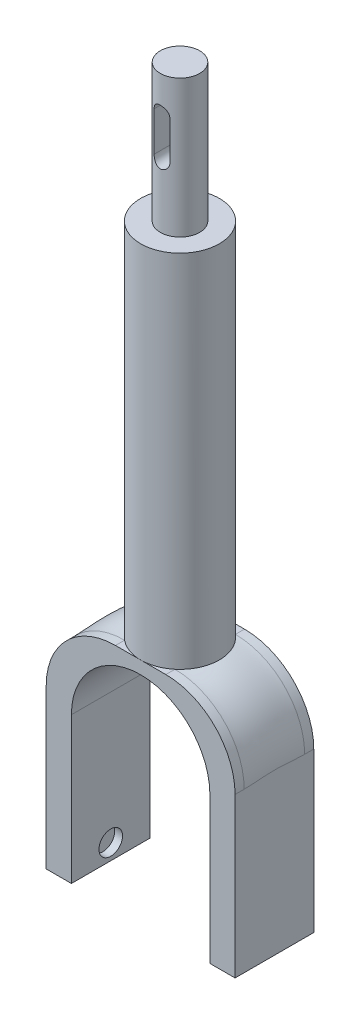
ISO-10303-21;
HEADER;
FILE_DESCRIPTION(('STEP AP214'),'2;1');
FILE_NAME('part.step','',(''),(''),'','','');
FILE_SCHEMA(('AUTOMOTIVE_DESIGN { 1 0 10303 214 1 1 1 1 }'));
ENDSEC;
DATA;
#1=APPLICATION_CONTEXT('core data for automotive mechanical design processes');
#2=APPLICATION_PROTOCOL_DEFINITION('international standard','automotive_design',2000,#1);
#3=PRODUCT_CONTEXT('',#1,'mechanical');
#4=PRODUCT('Part','Part','',(#3));
#5=PRODUCT_RELATED_PRODUCT_CATEGORY('part','',(#4));
#6=PRODUCT_DEFINITION_FORMATION('','',#4);
#7=PRODUCT_DEFINITION_CONTEXT('part definition',#1,'design');
#8=PRODUCT_DEFINITION('design','',#6,#7);
#9=PRODUCT_DEFINITION_SHAPE('','',#8);
#10=(LENGTH_UNIT() NAMED_UNIT(*) SI_UNIT(.MILLI.,.METRE.));
#11=(NAMED_UNIT(*) PLANE_ANGLE_UNIT() SI_UNIT($,.RADIAN.));
#12=(NAMED_UNIT(*) SI_UNIT($,.STERADIAN.) SOLID_ANGLE_UNIT());
#13=UNCERTAINTY_MEASURE_WITH_UNIT(LENGTH_MEASURE(1.E-05),#10,'distance_accuracy_value','');
#14=(GEOMETRIC_REPRESENTATION_CONTEXT(3) GLOBAL_UNCERTAINTY_ASSIGNED_CONTEXT((#13)) GLOBAL_UNIT_ASSIGNED_CONTEXT((#10,
#11,#12)) REPRESENTATION_CONTEXT('',''));
#15=CARTESIAN_POINT('',(0.,0.,0.));
#16=DIRECTION('',(0.,0.,1.));
#17=DIRECTION('',(1.,0.,0.));
#18=AXIS2_PLACEMENT_3D('',#15,#16,#17);
#19=CARTESIAN_POINT('',(0.,0.,0.));
#20=DIRECTION('',(0.,1.,0.));
#21=DIRECTION('',(0.,0.,1.));
#22=AXIS2_PLACEMENT_3D('',#19,#20,#21);
#23=PLANE('',#22);
#24=DIRECTION('',(1.,0.,0.));
#25=VECTOR('',#24,1.);
#26=CARTESIAN_POINT('',(-15.24,0.,-6.35));
#27=LINE('',#26,#25);
#28=CARTESIAN_POINT('',(-4.064,0.,-6.35));
#29=VERTEX_POINT('',#28);
#30=CARTESIAN_POINT('',(0.,0.,-6.35));
#31=VERTEX_POINT('',#30);
#32=EDGE_CURVE('E265',#29,#31,#27,.T.);
#33=ORIENTED_EDGE('',*,*,#32,.F.);
#34=DIRECTION('',(0.,0.,-1.));
#35=VECTOR('',#34,1.);
#36=CARTESIAN_POINT('',(-4.064,0.,6.35));
#37=LINE('',#36,#35);
#38=CARTESIAN_POINT('',(-4.064,0.,-4.87918066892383));
#39=VERTEX_POINT('',#38);
#40=EDGE_CURVE('E382',#29,#39,#37,.F.);
#41=ORIENTED_EDGE('',*,*,#40,.T.);
#42=CARTESIAN_POINT('',(0.,0.,0.));
#43=DIRECTION('',(0.,1.,0.));
#44=DIRECTION('',(0.,0.,1.));
#45=AXIS2_PLACEMENT_3D('',#42,#43,#44);
#46=CIRCLE('',#45,6.35);
#47=EDGE_CURVE('E301',#31,#39,#46,.T.);
#48=ORIENTED_EDGE('',*,*,#47,.F.);
#49=EDGE_LOOP('',(#33,#41,#48));
#50=FACE_BOUND('',#49,.T.);
#51=ADVANCED_FACE('F35',(#50),#23,.T.);
#52=DIRECTION('',(-1.,0.,0.));
#53=VECTOR('',#52,1.);
#54=CARTESIAN_POINT('',(-15.24,0.,6.35));
#55=LINE('',#54,#53);
#56=CARTESIAN_POINT('',(4.06399999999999,0.,6.35));
#57=VERTEX_POINT('',#56);
#58=CARTESIAN_POINT('',(0.,0.,6.35));
#59=VERTEX_POINT('',#58);
#60=EDGE_CURVE('E276',#57,#59,#55,.T.);
#61=ORIENTED_EDGE('',*,*,#60,.F.);
#62=DIRECTION('',(0.,0.,1.));
#63=VECTOR('',#62,1.);
#64=CARTESIAN_POINT('',(4.064,0.,-6.35));
#65=LINE('',#64,#63);
#66=CARTESIAN_POINT('',(4.064,0.,4.87918066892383));
#67=VERTEX_POINT('',#66);
#68=EDGE_CURVE('E400',#57,#67,#65,.F.);
#69=ORIENTED_EDGE('',*,*,#68,.T.);
#70=EDGE_CURVE('E297',#59,#67,#46,.T.);
#71=ORIENTED_EDGE('',*,*,#70,.F.);
#72=EDGE_LOOP('',(#61,#69,#71));
#73=FACE_BOUND('',#72,.T.);
#74=ADVANCED_FACE('F460',(#73),#23,.T.);
#75=CARTESIAN_POINT('',(-15.24,-36.83,6.35));
#76=DIRECTION('',(0.,0.,-1.));
#77=DIRECTION('',(-1.,0.,0.));
#78=AXIS2_PLACEMENT_3D('',#75,#76,#77);
#79=PLANE('',#78);
#80=CARTESIAN_POINT('',(-4.064,0.,6.35));
#81=VERTEX_POINT('',#80);
#82=EDGE_CURVE('E255',#59,#81,#55,.T.);
#83=ORIENTED_EDGE('',*,*,#82,.T.);
#84=CARTESIAN_POINT('',(-4.064,-11.176,6.35));
#85=DIRECTION('',(0.,0.,-1.));
#86=DIRECTION('',(-1.,0.,0.));
#87=AXIS2_PLACEMENT_3D('',#84,#85,#86);
#88=CIRCLE('',#87,11.176);
#89=CARTESIAN_POINT('',(-15.24,-11.176,6.35));
#90=VERTEX_POINT('',#89);
#91=EDGE_CURVE('E233',#81,#90,#88,.F.);
#92=ORIENTED_EDGE('',*,*,#91,.T.);
#93=DIRECTION('',(0.,1.,0.));
#94=VECTOR('',#93,1.);
#95=CARTESIAN_POINT('',(-15.24,-36.83,6.35));
#96=LINE('',#95,#94);
#97=CARTESIAN_POINT('',(-15.24,-36.83,6.35));
#98=VERTEX_POINT('',#97);
#99=EDGE_CURVE('E286',#98,#90,#96,.T.);
#100=ORIENTED_EDGE('',*,*,#99,.F.);
#101=DIRECTION('',(-1.,0.,0.));
#102=VECTOR('',#101,1.);
#103=CARTESIAN_POINT('',(-15.24,-36.83,6.35));
#104=LINE('',#103,#102);
#105=CARTESIAN_POINT('',(-11.176,-36.83,6.35));
#106=VERTEX_POINT('',#105);
#107=EDGE_CURVE('E264',#106,#98,#104,.T.);
#108=ORIENTED_EDGE('',*,*,#107,.F.);
#109=DIRECTION('',(0.,1.,0.));
#110=VECTOR('',#109,1.);
#111=CARTESIAN_POINT('',(-11.176,0.,6.35));
#112=LINE('',#111,#110);
#113=CARTESIAN_POINT('',(-11.176,-13.2334,6.35));
#114=VERTEX_POINT('',#113);
#115=EDGE_CURVE('E238',#106,#114,#112,.T.);
#116=ORIENTED_EDGE('',*,*,#115,.T.);
#117=CARTESIAN_POINT('',(0.,-13.2334,6.35));
#118=DIRECTION('',(0.,0.,1.));
#119=DIRECTION('',(1.,0.,0.));
#120=AXIS2_PLACEMENT_3D('',#117,#118,#119);
#121=CIRCLE('',#120,11.176);
#122=CARTESIAN_POINT('',(11.176,-13.2334,6.35));
#123=VERTEX_POINT('',#122);
#124=EDGE_CURVE('E246',#114,#123,#121,.F.);
#125=ORIENTED_EDGE('',*,*,#124,.T.);
#126=DIRECTION('',(0.,1.,0.));
#127=VECTOR('',#126,1.);
#128=CARTESIAN_POINT('',(11.176,0.,6.35));
#129=LINE('',#128,#127);
#130=CARTESIAN_POINT('',(11.176,-36.83,6.35));
#131=VERTEX_POINT('',#130);
#132=EDGE_CURVE('E243',#131,#123,#129,.T.);
#133=ORIENTED_EDGE('',*,*,#132,.F.);
#134=CARTESIAN_POINT('',(15.24,-36.83,6.35));
#135=VERTEX_POINT('',#134);
#136=EDGE_CURVE('E266',#135,#131,#104,.T.);
#137=ORIENTED_EDGE('',*,*,#136,.F.);
#138=DIRECTION('',(0.,1.,0.));
#139=VECTOR('',#138,1.);
#140=CARTESIAN_POINT('',(15.24,-36.83,6.35));
#141=LINE('',#140,#139);
#142=CARTESIAN_POINT('',(15.24,-11.176,6.35));
#143=VERTEX_POINT('',#142);
#144=EDGE_CURVE('E289',#135,#143,#141,.T.);
#145=ORIENTED_EDGE('',*,*,#144,.T.);
#146=CARTESIAN_POINT('',(4.064,-11.176,6.35));
#147=DIRECTION('',(0.,0.,-1.));
#148=DIRECTION('',(-1.,0.,0.));
#149=AXIS2_PLACEMENT_3D('',#146,#147,#148);
#150=CIRCLE('',#149,11.176);
#151=EDGE_CURVE('E420',#143,#57,#150,.F.);
#152=ORIENTED_EDGE('',*,*,#151,.T.);
#153=ORIENTED_EDGE('',*,*,#60,.T.);
#154=EDGE_LOOP('',(#83,#92,#100,#108,#116,#125,#133,#137,#145,#152,#153));
#155=FACE_BOUND('',#154,.T.);
#156=ADVANCED_FACE('F426',(#155),#79,.F.);
#157=CARTESIAN_POINT('',(-15.24,-36.83,-6.35));
#158=DIRECTION('',(0.,0.,1.));
#159=DIRECTION('',(1.,0.,0.));
#160=AXIS2_PLACEMENT_3D('',#157,#158,#159);
#161=PLANE('',#160);
#162=DIRECTION('',(0.,1.,0.));
#163=VECTOR('',#162,1.);
#164=CARTESIAN_POINT('',(-15.24,-36.83,-6.35));
#165=LINE('',#164,#163);
#166=CARTESIAN_POINT('',(-15.24,-36.83,-6.35));
#167=VERTEX_POINT('',#166);
#168=CARTESIAN_POINT('',(-15.24,-11.176,-6.35));
#169=VERTEX_POINT('',#168);
#170=EDGE_CURVE('E283',#167,#169,#165,.T.);
#171=ORIENTED_EDGE('',*,*,#170,.T.);
#172=CARTESIAN_POINT('',(-4.064,-11.176,-6.35));
#173=DIRECTION('',(0.,0.,1.));
#174=DIRECTION('',(1.,0.,0.));
#175=AXIS2_PLACEMENT_3D('',#172,#173,#174);
#176=CIRCLE('',#175,11.176);
#177=EDGE_CURVE('E386',#169,#29,#176,.F.);
#178=ORIENTED_EDGE('',*,*,#177,.T.);
#179=ORIENTED_EDGE('',*,*,#32,.T.);
#180=CARTESIAN_POINT('',(4.064,0.,-6.35));
#181=VERTEX_POINT('',#180);
#182=EDGE_CURVE('E279',#31,#181,#27,.T.);
#183=ORIENTED_EDGE('',*,*,#182,.T.);
#184=CARTESIAN_POINT('',(4.064,-11.176,-6.35));
#185=DIRECTION('',(0.,0.,1.));
#186=DIRECTION('',(1.,0.,0.));
#187=AXIS2_PLACEMENT_3D('',#184,#185,#186);
#188=CIRCLE('',#187,11.176);
#189=CARTESIAN_POINT('',(15.24,-11.176,-6.35));
#190=VERTEX_POINT('',#189);
#191=EDGE_CURVE('E398',#181,#190,#188,.F.);
#192=ORIENTED_EDGE('',*,*,#191,.T.);
#193=DIRECTION('',(0.,1.,0.));
#194=VECTOR('',#193,1.);
#195=CARTESIAN_POINT('',(15.24,-36.83,-6.35));
#196=LINE('',#195,#194);
#197=CARTESIAN_POINT('',(15.24,-36.83,-6.35));
#198=VERTEX_POINT('',#197);
#199=EDGE_CURVE('E275',#198,#190,#196,.T.);
#200=ORIENTED_EDGE('',*,*,#199,.F.);
#201=DIRECTION('',(1.,0.,0.));
#202=VECTOR('',#201,1.);
#203=CARTESIAN_POINT('',(-15.24,-36.83,-6.35));
#204=LINE('',#203,#202);
#205=CARTESIAN_POINT('',(11.176,-36.83,-6.35));
#206=VERTEX_POINT('',#205);
#207=EDGE_CURVE('E271',#206,#198,#204,.T.);
#208=ORIENTED_EDGE('',*,*,#207,.F.);
#209=DIRECTION('',(0.,1.,0.));
#210=VECTOR('',#209,1.);
#211=CARTESIAN_POINT('',(11.176,0.,-6.35));
#212=LINE('',#211,#210);
#213=CARTESIAN_POINT('',(11.176,-13.2334,-6.35));
#214=VERTEX_POINT('',#213);
#215=EDGE_CURVE('E234',#206,#214,#212,.T.);
#216=ORIENTED_EDGE('',*,*,#215,.T.);
#217=CARTESIAN_POINT('',(0.,-13.2334,-6.35));
#218=DIRECTION('',(0.,0.,1.));
#219=DIRECTION('',(1.,0.,0.));
#220=AXIS2_PLACEMENT_3D('',#217,#218,#219);
#221=CIRCLE('',#220,11.176);
#222=CARTESIAN_POINT('',(-11.176,-13.2334,-6.35));
#223=VERTEX_POINT('',#222);
#224=EDGE_CURVE('E237',#223,#214,#221,.F.);
#225=ORIENTED_EDGE('',*,*,#224,.F.);
#226=DIRECTION('',(0.,1.,0.));
#227=VECTOR('',#226,1.);
#228=CARTESIAN_POINT('',(-11.176,0.,-6.35));
#229=LINE('',#228,#227);
#230=CARTESIAN_POINT('',(-11.176,-36.83,-6.35));
#231=VERTEX_POINT('',#230);
#232=EDGE_CURVE('E240',#231,#223,#229,.T.);
#233=ORIENTED_EDGE('',*,*,#232,.F.);
#234=EDGE_CURVE('E272',#167,#231,#204,.T.);
#235=ORIENTED_EDGE('',*,*,#234,.F.);
#236=EDGE_LOOP('',(#171,#178,#179,#183,#192,#200,#208,#216,#225,#233,#235));
#237=FACE_BOUND('',#236,.T.);
#238=ADVANCED_FACE('F441',(#237),#161,.F.);
#239=CARTESIAN_POINT('',(0.,-36.83,0.));
#240=DIRECTION('',(0.,1.,0.));
#241=DIRECTION('',(0.,0.,1.));
#242=AXIS2_PLACEMENT_3D('',#239,#240,#241);
#243=PLANE('',#242);
#244=DIRECTION('',(0.,0.,1.));
#245=VECTOR('',#244,1.);
#246=CARTESIAN_POINT('',(-11.176,-36.83,-6.35));
#247=LINE('',#246,#245);
#248=EDGE_CURVE('E252',#231,#106,#247,.T.);
#249=ORIENTED_EDGE('',*,*,#248,.T.);
#250=ORIENTED_EDGE('',*,*,#107,.T.);
#251=DIRECTION('',(0.,0.,-1.));
#252=VECTOR('',#251,1.);
#253=CARTESIAN_POINT('',(-15.24,-36.83,-6.35));
#254=LINE('',#253,#252);
#255=EDGE_CURVE('E269',#98,#167,#254,.T.);
#256=ORIENTED_EDGE('',*,*,#255,.T.);
#257=ORIENTED_EDGE('',*,*,#234,.T.);
#258=EDGE_LOOP('',(#249,#250,#256,#257));
#259=FACE_BOUND('',#258,.T.);
#260=ADVANCED_FACE('F481',(#259),#243,.F.);
#261=CARTESIAN_POINT('',(0.,58.18124,0.));
#262=DIRECTION('',(0.,-1.,0.));
#263=DIRECTION('',(0.,0.,-1.));
#264=AXIS2_PLACEMENT_3D('',#261,#262,#263);
#265=CYLINDRICAL_SURFACE('',#264,6.35);
#266=CARTESIAN_POINT('',(0.,58.18124,0.));
#267=DIRECTION('',(0.,1.,0.));
#268=DIRECTION('',(0.,0.,1.));
#269=AXIS2_PLACEMENT_3D('',#266,#267,#268);
#270=CIRCLE('',#269,6.35);
#271=CARTESIAN_POINT('',(0.,58.18124,6.35));
#272=VERTEX_POINT('',#271);
#273=EDGE_CURVE('E293',#272,#272,#270,.T.);
#274=ORIENTED_EDGE('',*,*,#273,.F.);
#275=EDGE_LOOP('',(#274));
#276=FACE_BOUND('',#275,.T.);
#277=ORIENTED_EDGE('',*,*,#70,.T.);
#278=CARTESIAN_POINT('',(4.064,0.,-4.87918066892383));
#279=VERTEX_POINT('',#278);
#280=EDGE_CURVE('E300',#67,#279,#46,.T.);
#281=ORIENTED_EDGE('',*,*,#280,.T.);
#282=EDGE_CURVE('E440',#279,#31,#46,.T.);
#283=ORIENTED_EDGE('',*,*,#282,.T.);
#284=ORIENTED_EDGE('',*,*,#47,.T.);
#285=CARTESIAN_POINT('',(-4.064,0.,4.87918066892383));
#286=VERTEX_POINT('',#285);
#287=EDGE_CURVE('E451',#39,#286,#46,.T.);
#288=ORIENTED_EDGE('',*,*,#287,.T.);
#289=EDGE_CURVE('E292',#286,#59,#46,.T.);
#290=ORIENTED_EDGE('',*,*,#289,.T.);
#291=EDGE_LOOP('',(#277,#281,#283,#284,#288,#290));
#292=FACE_BOUND('',#291,.T.);
#293=ADVANCED_FACE('F321',(#276,#292),#265,.T.);
#294=CARTESIAN_POINT('',(0.,58.18124,0.));
#295=DIRECTION('',(0.,1.,0.));
#296=DIRECTION('',(0.,0.,1.));
#297=AXIS2_PLACEMENT_3D('',#294,#295,#296);
#298=PLANE('',#297);
#299=CARTESIAN_POINT('',(0.,58.18124,0.));
#300=DIRECTION('',(0.,1.,0.));
#301=DIRECTION('',(0.,0.,1.));
#302=AXIS2_PLACEMENT_3D('',#299,#300,#301);
#303=CIRCLE('',#302,3.175);
#304=CARTESIAN_POINT('',(0.,58.18124,3.175));
#305=VERTEX_POINT('',#304);
#306=EDGE_CURVE('E170',#305,#305,#303,.T.);
#307=ORIENTED_EDGE('',*,*,#306,.F.);
#308=EDGE_LOOP('',(#307));
#309=FACE_BOUND('',#308,.T.);
#310=ORIENTED_EDGE('',*,*,#273,.T.);
#311=EDGE_LOOP('',(#310));
#312=FACE_BOUND('',#311,.T.);
#313=ADVANCED_FACE('F473',(#309,#312),#298,.T.);
#314=ORIENTED_EDGE('',*,*,#282,.F.);
#315=DIRECTION('',(0.,0.,1.));
#316=VECTOR('',#315,1.);
#317=CARTESIAN_POINT('',(4.064,0.,-6.35));
#318=LINE('',#317,#316);
#319=EDGE_CURVE('E406',#279,#181,#318,.F.);
#320=ORIENTED_EDGE('',*,*,#319,.T.);
#321=ORIENTED_EDGE('',*,*,#182,.F.);
#322=EDGE_LOOP('',(#314,#320,#321));
#323=FACE_BOUND('',#322,.T.);
#324=ADVANCED_FACE('F438',(#323),#23,.T.);
#325=ORIENTED_EDGE('',*,*,#289,.F.);
#326=DIRECTION('',(0.,0.,-1.));
#327=VECTOR('',#326,1.);
#328=CARTESIAN_POINT('',(-4.064,0.,6.35));
#329=LINE('',#328,#327);
#330=EDGE_CURVE('E384',#286,#81,#329,.F.);
#331=ORIENTED_EDGE('',*,*,#330,.T.);
#332=ORIENTED_EDGE('',*,*,#82,.F.);
#333=EDGE_LOOP('',(#325,#331,#332));
#334=FACE_BOUND('',#333,.T.);
#335=ADVANCED_FACE('F459',(#334),#23,.T.);
#336=CARTESIAN_POINT('',(15.24,-36.83,-6.35));
#337=DIRECTION('',(-1.,0.,0.));
#338=DIRECTION('',(0.,0.,1.));
#339=AXIS2_PLACEMENT_3D('',#336,#337,#338);
#340=PLANE('',#339);
#341=ORIENTED_EDGE('',*,*,#199,.T.);
#342=DIRECTION('',(0.,0.,1.));
#343=VECTOR('',#342,1.);
#344=CARTESIAN_POINT('',(15.24,-11.176,6.35));
#345=LINE('',#344,#343);
#346=CARTESIAN_POINT('',(15.24,-11.176,-4.87918066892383));
#347=VERTEX_POINT('',#346);
#348=EDGE_CURVE('E311',#190,#347,#345,.T.);
#349=ORIENTED_EDGE('',*,*,#348,.T.);
#350=CARTESIAN_POINT('',(2.74763826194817,0.,-5.72476933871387));
#351=CARTESIAN_POINT('',(15.24,1.4357644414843,-5.35859499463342));
#352=CARTESIAN_POINT('',(15.24,-10.7539725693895,-8.46743988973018));
#353=CARTESIAN_POINT('',(2.80117006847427,0.,-5.69901518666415));
#354=CARTESIAN_POINT('',(15.24,1.37668264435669,-5.37332837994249));
#355=CARTESIAN_POINT('',(15.24,-10.8057462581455,-8.26450805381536));
#356=CARTESIAN_POINT('',(2.85778508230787,0.,-5.67097475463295));
#357=CARTESIAN_POINT('',(15.24,1.31305602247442,-5.38314494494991));
#358=CARTESIAN_POINT('',(15.24,-10.8524202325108,-8.06029682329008));
#359=CARTESIAN_POINT('',(2.97803408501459,0.,-5.60879539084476));
#360=CARTESIAN_POINT('',(15.24,1.17703855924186,-5.3903487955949));
#361=CARTESIAN_POINT('',(15.24,-10.9358558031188,-7.64991783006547));
#362=CARTESIAN_POINT('',(3.04166603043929,0.,-5.57465823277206));
#363=CARTESIAN_POINT('',(15.24,1.10474641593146,-5.38781137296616));
#364=CARTESIAN_POINT('',(15.24,-10.9726202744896,-7.44375065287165));
#365=CARTESIAN_POINT('',(3.17643311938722,0.,-5.49897006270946));
#366=CARTESIAN_POINT('',(15.24,0.952051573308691,-5.36810055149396));
#367=CARTESIAN_POINT('',(15.24,-11.0363651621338,-7.03116327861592));
#368=CARTESIAN_POINT('',(3.24752181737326,0.,-5.45746394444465));
#369=CARTESIAN_POINT('',(15.24,0.871810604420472,-5.35111583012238));
#370=CARTESIAN_POINT('',(15.24,-11.0634019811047,-6.82475173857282));
#371=CARTESIAN_POINT('',(3.39840543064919,0.,-5.3648117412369));
#372=CARTESIAN_POINT('',(15.24,0.70332667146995,-5.29995650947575));
#373=CARTESIAN_POINT('',(15.24,-11.1084445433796,-6.4109418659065));
#374=CARTESIAN_POINT('',(3.47820081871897,0.,-5.31366513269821));
#375=CARTESIAN_POINT('',(15.24,0.615203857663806,-5.26592352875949));
#376=CARTESIAN_POINT('',(15.24,-11.1264497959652,-6.20354348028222));
#377=CARTESIAN_POINT('',(3.64748526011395,0.,-5.19892722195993));
#378=CARTESIAN_POINT('',(15.24,0.431537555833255,-5.17759667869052));
#379=CARTESIAN_POINT('',(15.24,-11.1540494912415,-5.78777211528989));
#380=CARTESIAN_POINT('',(3.73699377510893,0.,-5.13531072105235));
#381=CARTESIAN_POINT('',(15.24,0.336107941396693,-5.12345528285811));
#382=CARTESIAN_POINT('',(15.24,-11.1636266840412,-5.57939801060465));
#383=CARTESIAN_POINT('',(3.92615003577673,0.,-4.99218783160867));
#384=CARTESIAN_POINT('',(15.24,0.139190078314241,-4.99156520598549));
#385=CARTESIAN_POINT('',(15.24,-11.1750928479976,-5.16244766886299));
#386=CARTESIAN_POINT('',(4.02579786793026,0.,-4.91268130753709));
#387=CARTESIAN_POINT('',(15.24,0.0378331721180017,-4.91407180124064));
#388=CARTESIAN_POINT('',(15.24,-11.1769817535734,-4.95387143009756));
#389=CARTESIAN_POINT('',(4.235479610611,0.,-4.73311024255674));
#390=CARTESIAN_POINT('',(15.24,-0.169349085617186,-4.73164795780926));
#391=CARTESIAN_POINT('',(15.24,-11.1740791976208,-4.53630655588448));
#392=CARTESIAN_POINT('',(4.34553646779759,0.,-4.63299968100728));
#393=CARTESIAN_POINT('',(15.24,-0.275067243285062,-4.62697686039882));
#394=CARTESIAN_POINT('',(15.24,-11.1692726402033,-4.32731805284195));
#395=CARTESIAN_POINT('',(4.57477583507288,0.,-4.40680277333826));
#396=CARTESIAN_POINT('',(15.24,-0.48809137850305,-4.38652936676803));
#397=CARTESIAN_POINT('',(15.24,-11.1542453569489,-3.90955884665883));
#398=CARTESIAN_POINT('',(4.69395788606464,0.,-4.28071773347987));
#399=CARTESIAN_POINT('',(15.24,-0.595314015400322,-4.25113592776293));
#400=CARTESIAN_POINT('',(15.24,-11.1440249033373,-3.70078813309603));
#401=CARTESIAN_POINT('',(4.91270886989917,0.,-4.02612011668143));
#402=CARTESIAN_POINT('',(15.24,-0.78543223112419,-3.97764307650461));
#403=CARTESIAN_POINT('',(15.24,-11.1223442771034,-3.32733648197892));
#404=CARTESIAN_POINT('',(5.01113462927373,0.,-3.90368858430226));
#405=CARTESIAN_POINT('',(15.24,-0.868534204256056,-3.84655212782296));
#406=CARTESIAN_POINT('',(15.24,-11.111596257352,-3.16261207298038));
#407=CARTESIAN_POINT('',(5.20897864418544,0.,-3.63549470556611));
#408=CARTESIAN_POINT('',(15.24,-1.03087914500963,-3.56169552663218));
#409=CARTESIAN_POINT('',(15.24,-11.0886999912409,-2.83325902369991));
#410=CARTESIAN_POINT('',(5.30839692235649,0.,-3.48973182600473));
#411=CARTESIAN_POINT('',(15.24,-1.11015451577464,-3.4081087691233));
#412=CARTESIAN_POINT('',(15.24,-11.076551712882,-2.668630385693));
#413=CARTESIAN_POINT('',(5.50401168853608,0.,-3.17223635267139));
#414=CARTESIAN_POINT('',(15.24,-1.26187416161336,-3.07781031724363));
#415=CARTESIAN_POINT('',(15.24,-11.0519417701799,-2.33936360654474));
#416=CARTESIAN_POINT('',(5.60020751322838,0.,-3.00049845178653));
#417=CARTESIAN_POINT('',(15.24,-1.33439677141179,-2.90121502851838));
#418=CARTESIAN_POINT('',(15.24,-11.0394800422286,-2.17472547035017));
#419=CARTESIAN_POINT('',(5.78350014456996,0.,-2.62988341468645));
#420=CARTESIAN_POINT('',(15.24,-1.46913447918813,-2.52578388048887));
#421=CARTESIAN_POINT('',(15.24,-11.0154353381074,-1.84538337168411));
#422=CARTESIAN_POINT('',(5.87059698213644,0.,-2.43100637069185));
#423=CARTESIAN_POINT('',(15.24,-1.53147566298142,-2.32695911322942));
#424=CARTESIAN_POINT('',(15.24,-11.0038523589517,-1.6806794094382));
#425=CARTESIAN_POINT('',(6.02835682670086,0.,-2.00801369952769));
#426=CARTESIAN_POINT('',(15.24,-1.64205201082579,-1.91024332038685));
#427=CARTESIAN_POINT('',(15.24,-10.9827970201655,-1.35154977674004));
#428=CARTESIAN_POINT('',(6.09906082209,0.,-1.78396314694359));
#429=CARTESIAN_POINT('',(15.24,-1.6904760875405,-1.69225429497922));
#430=CARTESIAN_POINT('',(15.24,-10.9733193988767,-1.18712445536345));
#431=CARTESIAN_POINT('',(6.21701229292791,0.,-1.31512430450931));
#432=CARTESIAN_POINT('',(15.24,-1.77007318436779,-1.24153637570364));
#433=CARTESIAN_POINT('',(15.24,-10.9575119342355,-0.858120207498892));
#434=CARTESIAN_POINT('',(6.26426030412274,0.,-1.0703364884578));
#435=CARTESIAN_POINT('',(15.24,-1.80139418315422,-1.0084697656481));
#436=CARTESIAN_POINT('',(15.24,-10.9511820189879,-0.693541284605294));
#437=CARTESIAN_POINT('',(6.32951709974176,0.,-0.568800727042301));
#438=CARTESIAN_POINT('',(15.24,-1.84434651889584,-0.534454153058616));
#439=CARTESIAN_POINT('',(15.24,-10.9424448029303,-0.364354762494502));
#440=CARTESIAN_POINT('',(6.34754005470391,0.,-0.312058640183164));
#441=CARTESIAN_POINT('',(15.24,-1.85608196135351,-0.293011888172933));
#442=CARTESIAN_POINT('',(15.24,-10.9400356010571,-0.199747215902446));
#443=CARTESIAN_POINT('',(6.35198532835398,0.,0.202263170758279));
#444=CARTESIAN_POINT('',(15.24,-1.85898042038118,0.189887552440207));
#445=CARTESIAN_POINT('',(15.24,-10.9394410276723,0.129475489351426));
#446=CARTESIAN_POINT('',(6.33840771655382,0.,0.459842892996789));
#447=CARTESIAN_POINT('',(15.24,-1.85015028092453,0.431911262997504));
#448=CARTESIAN_POINT('',(15.24,-10.9412556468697,0.294090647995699));
#449=CARTESIAN_POINT('',(6.28160477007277,0.,0.9632823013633));
#450=CARTESIAN_POINT('',(15.24,-1.81284944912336,0.906951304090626));
#451=CARTESIAN_POINT('',(15.24,-10.9488593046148,0.622482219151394));
#452=CARTESIAN_POINT('',(6.23851343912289,0.,1.20918961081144));
#453=CARTESIAN_POINT('',(15.24,-1.7843847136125,1.14051374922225));
#454=CARTESIAN_POINT('',(15.24,-10.9546303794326,0.786259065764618));
#455=CARTESIAN_POINT('',(6.12812770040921,0.,1.68151738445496));
#456=CARTESIAN_POINT('',(15.24,-1.71023231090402,1.5931984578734));
#457=CARTESIAN_POINT('',(15.24,-10.9694242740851,1.11366397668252));
#458=CARTESIAN_POINT('',(6.06083268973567,0.,1.90793736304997));
#459=CARTESIAN_POINT('',(15.24,-1.6644036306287,1.8126798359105));
#460=CARTESIAN_POINT('',(15.24,-10.9784471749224,1.27729203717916));
#461=CARTESIAN_POINT('',(5.90908198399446,0.,2.33601632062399));
#462=CARTESIAN_POINT('',(15.24,-1.55872682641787,2.23270012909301));
#463=CARTESIAN_POINT('',(15.24,-10.9987255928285,1.60450423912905));
#464=CARTESIAN_POINT('',(5.82461590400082,0.,2.53766019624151));
#465=CARTESIAN_POINT('',(15.24,-1.49871648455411,2.43340271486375));
#466=CARTESIAN_POINT('',(15.24,-11.0099824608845,1.76808829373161));
#467=CARTESIAN_POINT('',(5.64565955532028,0.,2.91420011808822));
#468=CARTESIAN_POINT('',(15.24,-1.36822140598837,2.81313781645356));
#469=CARTESIAN_POINT('',(15.24,-11.0335532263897,2.09517730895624));
#470=CARTESIAN_POINT('',(5.55116930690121,0.,3.08909621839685));
#471=CARTESIAN_POINT('',(15.24,-1.29760705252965,2.99218177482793));
#472=CARTESIAN_POINT('',(15.24,-11.0458671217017,2.25868226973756));
#473=CARTESIAN_POINT('',(5.35794595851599,0.,3.41330368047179));
#474=CARTESIAN_POINT('',(15.24,-1.1491070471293,3.32807700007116));
#475=CARTESIAN_POINT('',(15.24,-11.0704021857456,2.58602831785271));
#476=CARTESIAN_POINT('',(5.25920475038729,0.,3.56256317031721));
#477=CARTESIAN_POINT('',(15.24,-1.07112190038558,3.48477535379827));
#478=CARTESIAN_POINT('',(15.24,-11.0826231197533,2.74986942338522));
#479=CARTESIAN_POINT('',(5.06210351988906,0.,3.83747707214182));
#480=CARTESIAN_POINT('',(15.24,-0.910942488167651,3.77591640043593));
#481=CARTESIAN_POINT('',(15.24,-11.1058525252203,3.07764057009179));
#482=CARTESIAN_POINT('',(4.9637434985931,0.,3.96313141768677));
#483=CARTESIAN_POINT('',(15.24,-0.828708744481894,3.91018866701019));
#484=CARTESIAN_POINT('',(15.24,-11.1168609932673,3.24157061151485));
#485=CARTESIAN_POINT('',(4.77040407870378,0.,4.19385153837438));
#486=CARTESIAN_POINT('',(15.24,-0.662492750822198,4.15756277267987));
#487=CARTESIAN_POINT('',(15.24,-11.1366940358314,3.56949907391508));
#488=CARTESIAN_POINT('',(4.67542330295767,0.,4.29892578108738));
#489=CARTESIAN_POINT('',(15.24,-0.57851156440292,4.27047959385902));
#490=CARTESIAN_POINT('',(15.24,-11.1455195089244,3.73349743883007));
#491=CARTESIAN_POINT('',(4.49056408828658,0.,4.49167574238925));
#492=CARTESIAN_POINT('',(15.24,-0.410694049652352,4.47676035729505));
#493=CARTESIAN_POINT('',(15.24,-11.1601638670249,4.06162665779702));
#494=CARTESIAN_POINT('',(4.40068547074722,0.,4.57935207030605));
#495=CARTESIAN_POINT('',(15.24,-0.32688773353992,4.56993376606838));
#496=CARTESIAN_POINT('',(15.24,-11.1659828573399,4.22575750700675));
#497=CARTESIAN_POINT('',(4.21558599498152,0.,4.75071276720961));
#498=CARTESIAN_POINT('',(15.24,-0.149984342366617,4.74956321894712));
#499=CARTESIAN_POINT('',(15.24,-11.1744326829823,4.57555826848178));
#500=CARTESIAN_POINT('',(4.12120051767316,0.,4.83238023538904));
#501=CARTESIAN_POINT('',(15.24,-0.0572697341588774,4.83321538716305));
#502=CARTESIAN_POINT('',(15.24,-11.1765478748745,4.76124161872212));
#503=CARTESIAN_POINT('',(3.94052561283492,0.,4.98080333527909));
#504=CARTESIAN_POINT('',(15.24,0.124476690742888,4.9803245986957));
#505=CARTESIAN_POINT('',(15.24,-11.175208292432,5.13261420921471));
#506=CARTESIAN_POINT('',(3.85423700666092,0.,5.04755745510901));
#507=CARTESIAN_POINT('',(15.24,0.213420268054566,5.04356776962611));
#508=CARTESIAN_POINT('',(15.24,-11.1717529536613,5.31830344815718));
#509=CARTESIAN_POINT('',(3.68967793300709,0.,5.1690636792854));
#510=CARTESIAN_POINT('',(15.24,0.386410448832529,5.15223921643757));
#511=CARTESIAN_POINT('',(15.24,-11.1586084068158,5.68933611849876));
#512=CARTESIAN_POINT('',(3.61140182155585,0.,5.22382426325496));
#513=CARTESIAN_POINT('',(15.24,0.470367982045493,5.19750989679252));
#514=CARTESIAN_POINT('',(15.24,-11.1489236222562,5.87467970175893));
#515=CARTESIAN_POINT('',(3.46235683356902,0.,5.3237791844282));
#516=CARTESIAN_POINT('',(15.24,0.632652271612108,5.27254353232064));
#517=CARTESIAN_POINT('',(15.24,-11.1227938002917,6.24489137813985));
#518=CARTESIAN_POINT('',(3.39158778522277,0.,5.36897374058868));
#519=CARTESIAN_POINT('',(15.24,0.710887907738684,5.30217372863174));
#520=CARTESIAN_POINT('',(15.24,-11.106348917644,6.42975948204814));
#521=CARTESIAN_POINT('',(3.25682638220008,0.,5.4517743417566));
#522=CARTESIAN_POINT('',(15.24,0.861349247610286,5.34801710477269));
#523=CARTESIAN_POINT('',(15.24,-11.0662389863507,6.79911557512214));
#524=CARTESIAN_POINT('',(3.19284882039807,0.,5.48936397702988));
#525=CARTESIAN_POINT('',(15.24,0.93347476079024,5.36409939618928));
#526=CARTESIAN_POINT('',(15.24,-11.0425585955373,6.9836019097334));
#527=CARTESIAN_POINT('',(3.0712130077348,0.,5.55832942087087));
#528=CARTESIAN_POINT('',(15.24,1.07117342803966,5.38458145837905));
#529=CARTESIAN_POINT('',(15.24,-10.9876686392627,7.35145007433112));
#530=CARTESIAN_POINT('',(3.01355458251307,0.,5.58970540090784));
#531=CARTESIAN_POINT('',(15.24,1.13666859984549,5.38890598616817));
#532=CARTESIAN_POINT('',(15.24,-10.9564592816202,7.53481193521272));
#533=CARTESIAN_POINT('',(2.90381238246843,0.,5.64749924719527));
#534=CARTESIAN_POINT('',(15.24,1.26102930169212,5.38753558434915));
#535=CARTESIAN_POINT('',(15.24,-10.8861934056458,7.90043144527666));
#536=CARTESIAN_POINT('',(2.85174059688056,0.,5.67390653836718));
#537=CARTESIAN_POINT('',(15.24,1.31980998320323,5.38176481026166));
#538=CARTESIAN_POINT('',(15.24,-10.8471205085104,8.0826859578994));
#539=CARTESIAN_POINT('',(2.75272251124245,0.,5.72258385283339));
#540=CARTESIAN_POINT('',(15.24,1.43049805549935,5.36159372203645));
#541=CARTESIAN_POINT('',(15.24,-10.7610047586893,8.44533325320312));
#542=CARTESIAN_POINT('',(2.70577708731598,0.,5.74485316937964));
#543=CARTESIAN_POINT('',(15.24,1.48234295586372,5.34715350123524));
#544=CARTESIAN_POINT('',(15.24,-10.7139605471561,8.62572571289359));
#545=CARTESIAN_POINT('',(2.6611093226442,0.,5.76550060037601));
#546=CARTESIAN_POINT('',(15.24,1.53061015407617,5.32919658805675));
#547=CARTESIAN_POINT('',(15.24,-10.6628553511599,8.80497251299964));
#548=(BOUNDED_SURFACE() B_SPLINE_SURFACE(3,2,((#350,#351,#352),(#353,#354,#355),(#356,#357,
#358),(#359,#360,#361),(#362,#363,#364),(#365,#366,#367),(#368,#369,#370),(#371,#372,#373),
(#374,#375,#376),(#377,#378,#379),(#380,#381,#382),(#383,#384,#385),(#386,#387,#388),(#389,#390,
#391),(#392,#393,#394),(#395,#396,#397),(#398,#399,#400),(#401,#402,#403),(#404,#405,#406),
(#407,#408,#409),(#410,#411,#412),(#413,#414,#415),(#416,#417,#418),(#419,#420,#421),(#422,#423,
#424),(#425,#426,#427),(#428,#429,#430),(#431,#432,#433),(#434,#435,#436),(#437,#438,#439),
(#440,#441,#442),(#443,#444,#445),(#446,#447,#448),(#449,#450,#451),(#452,#453,#454),(#455,#456,
#457),(#458,#459,#460),(#461,#462,#463),(#464,#465,#466),(#467,#468,#469),(#470,#471,#472),
(#473,#474,#475),(#476,#477,#478),(#479,#480,#481),(#482,#483,#484),(#485,#486,#487),(#488,#489,
#490),(#491,#492,#493),(#494,#495,#496),(#497,#498,#499),(#500,#501,#502),(#503,#504,#505),
(#506,#507,#508),(#509,#510,#511),(#512,#513,#514),(#515,#516,#517),(#518,#519,#520),(#521,#522,
#523),(#524,#525,#526),(#527,#528,#529),(#530,#531,#532),(#533,#534,#535),(#536,#537,#538),
(#539,#540,#541),(#542,#543,#544),(#545,#546,#547)),.UNSPECIFIED.,.F.,.F.,
.F.) B_SPLINE_SURFACE_WITH_KNOTS((4,2,2,2,2,2,2,2,2,2,2,2,2,2,2,2,2,2,2,2,2,2,2,2,2,2,2,2,2,2,2,
2,4),(3,3),(0.,0.62820038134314,1.25621830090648,1.88053383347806,2.50488328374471,
3.13050765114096,3.7561373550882,4.38317991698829,5.01019095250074,5.50540619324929,
6.00063275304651,6.4959606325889,6.99128682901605,7.48536083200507,7.979423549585,
8.47324663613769,8.96706863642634,9.45866322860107,9.95027006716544,10.4421751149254,
10.934079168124,11.4269670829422,11.9198563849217,12.4125424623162,12.9052112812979,
13.4622246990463,14.019294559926,14.5759692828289,15.1326312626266,15.6904818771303,
16.2483170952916,16.8073264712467,17.3664312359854),(0.,1.),
.UNSPECIFIED.) GEOMETRIC_REPRESENTATION_ITEM() RATIONAL_B_SPLINE_SURFACE(((1.,0.664159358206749,
1.),(1.,0.665962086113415,1.),(1.,0.667861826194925,1.),(1.,0.671877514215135,1.),(1.,
0.673993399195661,1.),(1.,0.678451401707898,1.),(1.,0.680792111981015,1.),(1.,0.685731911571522,
1.),(1.,0.688331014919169,1.),(1.,0.693810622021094,1.),(1.,0.696691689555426,1.),(1.,
0.702738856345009,1.),(1.,0.705904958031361,1.),(1.,0.712518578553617,1.),(1.,0.715966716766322,
1.),(1.,0.723093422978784,1.),(1.,0.726771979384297,1.),(1.,0.733470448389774,1.),(1.,
0.736466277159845,1.),(1.,0.742451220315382,1.),(1.,0.745440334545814,1.),(1.,0.751287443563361,
1.),(1.,0.754145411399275,1.),(1.,0.759562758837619,1.),(1.,0.762122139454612,1.),(1.,
0.766738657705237,1.),(1.,0.768797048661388,1.),(1.,0.772221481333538,1.),(1.,0.773587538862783,
1.),(1.,0.775472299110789,1.),(1.,0.77599141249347,1.),(1.,0.776119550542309,1.),(1.,
0.77572857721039,1.),(1.,0.774088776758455,1.),(1.,0.772843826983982,1.),(1.,0.769642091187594,
1.),(1.,0.767685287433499,1.),(1.,0.763250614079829,1.),(1.,0.76077242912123,1.),(1.,
0.755492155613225,1.),(1.,0.752690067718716,1.),(1.,0.746925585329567,1.),(1.,0.743962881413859,
1.),(1.,0.738012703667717,1.),(1.,0.735025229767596,1.),(1.,0.729117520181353,1.),(1.,
0.726197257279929,1.),(1.,0.720480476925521,1.),(1.,0.717683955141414,1.),(1.,0.711892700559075,
1.),(1.,0.708919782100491,1.),(1.,0.703195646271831,1.),(1.,0.700444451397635,1.),(1.,
0.695169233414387,1.),(1.,0.69264505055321,1.),(1.,0.687814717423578,1.),(1.,0.685508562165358,
1.),(1.,0.681096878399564,1.),(1.,0.678991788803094,1.),(1.,0.674972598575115,1.),(1.,
0.673058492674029,1.),(1.,0.669401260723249,1.),(1.,0.667658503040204,1.),(1.,0.664332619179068,
1.),(1.,0.662749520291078,1.),(1.,0.661238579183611,1.))) REPRESENTATION_ITEM('') SURFACE());
#549=CARTESIAN_POINT('',(15.24,-10.7539725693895,-8.46743988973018));
#550=CARTESIAN_POINT('',(15.24,-10.8057462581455,-8.26450805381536));
#551=CARTESIAN_POINT('',(15.24,-10.8524202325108,-8.06029682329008));
#552=CARTESIAN_POINT('',(15.24,-10.9358558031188,-7.64991783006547));
#553=CARTESIAN_POINT('',(15.24,-10.9726202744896,-7.44375065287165));
#554=CARTESIAN_POINT('',(15.24,-11.0363651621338,-7.03116327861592));
#555=CARTESIAN_POINT('',(15.24,-11.0634019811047,-6.82475173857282));
#556=CARTESIAN_POINT('',(15.24,-11.1084445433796,-6.4109418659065));
#557=CARTESIAN_POINT('',(15.24,-11.1264497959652,-6.20354348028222));
#558=CARTESIAN_POINT('',(15.24,-11.1540494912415,-5.78777211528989));
#559=CARTESIAN_POINT('',(15.24,-11.1636266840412,-5.57939801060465));
#560=CARTESIAN_POINT('',(15.24,-11.1750928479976,-5.16244766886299));
#561=CARTESIAN_POINT('',(15.24,-11.1769817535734,-4.95387143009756));
#562=CARTESIAN_POINT('',(15.24,-11.1740791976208,-4.53630655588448));
#563=CARTESIAN_POINT('',(15.24,-11.1692726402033,-4.32731805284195));
#564=CARTESIAN_POINT('',(15.24,-11.1542453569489,-3.90955884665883));
#565=CARTESIAN_POINT('',(15.24,-11.1440249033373,-3.70078813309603));
#566=CARTESIAN_POINT('',(15.24,-11.1223442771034,-3.32733648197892));
#567=CARTESIAN_POINT('',(15.24,-11.111596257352,-3.16261207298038));
#568=CARTESIAN_POINT('',(15.24,-11.0886999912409,-2.83325902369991));
#569=CARTESIAN_POINT('',(15.24,-11.076551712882,-2.668630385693));
#570=CARTESIAN_POINT('',(15.24,-11.0519417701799,-2.33936360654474));
#571=CARTESIAN_POINT('',(15.24,-11.0394800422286,-2.17472547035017));
#572=CARTESIAN_POINT('',(15.24,-11.0154353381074,-1.84538337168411));
#573=CARTESIAN_POINT('',(15.24,-11.0038523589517,-1.6806794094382));
#574=CARTESIAN_POINT('',(15.24,-10.9827970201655,-1.35154977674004));
#575=CARTESIAN_POINT('',(15.24,-10.9733193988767,-1.18712445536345));
#576=CARTESIAN_POINT('',(15.24,-10.9575119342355,-0.858120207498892));
#577=CARTESIAN_POINT('',(15.24,-10.9511820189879,-0.693541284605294));
#578=CARTESIAN_POINT('',(15.24,-10.9424448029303,-0.364354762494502));
#579=CARTESIAN_POINT('',(15.24,-10.9400356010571,-0.199747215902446));
#580=CARTESIAN_POINT('',(15.24,-10.9394410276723,0.129475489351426));
#581=CARTESIAN_POINT('',(15.24,-10.9412556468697,0.294090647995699));
#582=CARTESIAN_POINT('',(15.24,-10.9488593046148,0.622482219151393));
#583=CARTESIAN_POINT('',(15.24,-10.9546303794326,0.786259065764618));
#584=CARTESIAN_POINT('',(15.24,-10.9694242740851,1.11366397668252));
#585=CARTESIAN_POINT('',(15.24,-10.9784471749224,1.27729203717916));
#586=CARTESIAN_POINT('',(15.24,-10.9987255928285,1.60450423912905));
#587=CARTESIAN_POINT('',(15.24,-11.0099824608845,1.76808829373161));
#588=CARTESIAN_POINT('',(15.24,-11.0335532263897,2.09517730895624));
#589=CARTESIAN_POINT('',(15.24,-11.0458671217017,2.25868226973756));
#590=CARTESIAN_POINT('',(15.24,-11.0704021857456,2.58602831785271));
#591=CARTESIAN_POINT('',(15.24,-11.0826231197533,2.74986942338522));
#592=CARTESIAN_POINT('',(15.24,-11.1058525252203,3.07764057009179));
#593=CARTESIAN_POINT('',(15.24,-11.1168609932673,3.24157061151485));
#594=CARTESIAN_POINT('',(15.24,-11.1366940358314,3.56949907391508));
#595=CARTESIAN_POINT('',(15.24,-11.1455195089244,3.73349743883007));
#596=CARTESIAN_POINT('',(15.24,-11.1601638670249,4.06162665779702));
#597=CARTESIAN_POINT('',(15.24,-11.1659828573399,4.22575750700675));
#598=CARTESIAN_POINT('',(15.24,-11.1744326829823,4.57555826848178));
#599=CARTESIAN_POINT('',(15.24,-11.1765478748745,4.76124161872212));
#600=CARTESIAN_POINT('',(15.24,-11.175208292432,5.13261420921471));
#601=CARTESIAN_POINT('',(15.24,-11.1717529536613,5.31830344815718));
#602=CARTESIAN_POINT('',(15.24,-11.1586084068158,5.68933611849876));
#603=CARTESIAN_POINT('',(15.24,-11.1489236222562,5.87467970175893));
#604=CARTESIAN_POINT('',(15.24,-11.1227938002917,6.24489137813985));
#605=CARTESIAN_POINT('',(15.24,-11.106348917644,6.42975948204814));
#606=CARTESIAN_POINT('',(15.24,-11.0662389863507,6.79911557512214));
#607=CARTESIAN_POINT('',(15.24,-11.0425585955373,6.9836019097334));
#608=CARTESIAN_POINT('',(15.24,-10.9876686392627,7.35145007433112));
#609=CARTESIAN_POINT('',(15.24,-10.9564592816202,7.53481193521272));
#610=CARTESIAN_POINT('',(15.24,-10.8861934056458,7.90043144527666));
#611=CARTESIAN_POINT('',(15.24,-10.8471205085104,8.0826859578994));
#612=CARTESIAN_POINT('',(15.24,-10.7610047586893,8.44533325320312));
#613=CARTESIAN_POINT('',(15.24,-10.7139605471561,8.62572571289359));
#614=CARTESIAN_POINT('',(15.24,-10.6628553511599,8.80497251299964));
#615=B_SPLINE_CURVE_WITH_KNOTS('',3,(#549,#550,#551,#552,#553,#554,#555,#556,#557,#558,#559,
#560,#561,#562,#563,#564,#565,#566,#567,#568,#569,#570,#571,#572,#573,#574,#575,#576,#577,#578,
#579,#580,#581,#582,#583,#584,#585,#586,#587,#588,#589,#590,#591,#592,#593,#594,#595,#596,#597,
#598,#599,#600,#601,#602,#603,#604,#605,#606,#607,#608,#609,#610,#611,#612,#613,#614),
.UNSPECIFIED.,.F.,.F.,(4,2,2,2,2,2,2,2,2,2,2,2,2,2,2,2,2,2,2,2,2,2,2,2,2,2,2,2,2,2,2,2,4),(0.,
0.62820038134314,1.25621830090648,1.88053383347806,2.50488328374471,3.13050765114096,
3.7561373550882,4.38317991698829,5.01019095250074,5.50540619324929,6.00063275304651,
6.4959606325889,6.99128682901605,7.48536083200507,7.979423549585,8.47324663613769,
8.96706863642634,9.45866322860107,9.95027006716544,10.4421751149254,10.934079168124,
11.4269670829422,11.9198563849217,12.4125424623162,12.9052112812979,13.4622246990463,
14.019294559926,14.5759692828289,15.1326312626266,15.6904818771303,16.2483170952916,
16.8073264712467,17.3664312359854),.UNSPECIFIED.);
#616=CARTESIAN_POINT('',(15.24,-11.176,4.87918066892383));
#617=VERTEX_POINT('',#616);
#618=EDGE_CURVE('E303',#347,#617,#615,.T.);
#619=ORIENTED_EDGE('',*,*,#618,.T.);
#620=DIRECTION('',(0.,0.,1.));
#621=VECTOR('',#620,1.);
#622=CARTESIAN_POINT('',(15.24,-11.176,6.35));
#623=LINE('',#622,#621);
#624=EDGE_CURVE('E296',#617,#143,#623,.T.);
#625=ORIENTED_EDGE('',*,*,#624,.T.);
#626=ORIENTED_EDGE('',*,*,#144,.F.);
#627=DIRECTION('',(0.,0.,1.));
#628=VECTOR('',#627,1.);
#629=CARTESIAN_POINT('',(15.24,-36.83,-6.35));
#630=LINE('',#629,#628);
#631=EDGE_CURVE('E261',#198,#135,#630,.T.);
#632=ORIENTED_EDGE('',*,*,#631,.F.);
#633=EDGE_LOOP('',(#341,#349,#619,#625,#626,#632));
#634=FACE_BOUND('',#633,.T.);
#635=ADVANCED_FACE('F313',(#634),#340,.F.);
#636=CARTESIAN_POINT('',(-15.24,-36.83,-6.35));
#637=DIRECTION('',(1.,0.,0.));
#638=DIRECTION('',(0.,0.,-1.));
#639=AXIS2_PLACEMENT_3D('',#636,#637,#638);
#640=PLANE('',#639);
#641=ORIENTED_EDGE('',*,*,#99,.T.);
#642=DIRECTION('',(0.,0.,-1.));
#643=VECTOR('',#642,1.);
#644=CARTESIAN_POINT('',(-15.24,-11.176,-6.35));
#645=LINE('',#644,#643);
#646=CARTESIAN_POINT('',(-15.24,-11.176,4.87918066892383));
#647=VERTEX_POINT('',#646);
#648=EDGE_CURVE('E388',#90,#647,#645,.T.);
#649=ORIENTED_EDGE('',*,*,#648,.T.);
#650=CARTESIAN_POINT('',(-2.74763828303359,0.,5.72476932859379));
#651=CARTESIAN_POINT('',(-15.24,1.43576441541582,5.35859498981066));
#652=CARTESIAN_POINT('',(-15.24,-10.7539725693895,8.46743988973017));
#653=CARTESIAN_POINT('',(-2.80117007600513,0.,5.69901518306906));
#654=CARTESIAN_POINT('',(-15.24,1.37668263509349,5.37332837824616));
#655=CARTESIAN_POINT('',(-15.24,-10.8057462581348,8.26450805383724));
#656=CARTESIAN_POINT('',(-2.85778508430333,0.,5.67097475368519));
#657=CARTESIAN_POINT('',(-15.24,1.31305602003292,5.38314494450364));
#658=CARTESIAN_POINT('',(-15.24,-10.8524202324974,8.06029682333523));
#659=CARTESIAN_POINT('',(-2.97803408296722,0.,5.60879539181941));
#660=CARTESIAN_POINT('',(-15.24,1.17703856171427,5.39034879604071));
#661=CARTESIAN_POINT('',(-15.24,-10.9358558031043,7.64991783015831));
#662=CARTESIAN_POINT('',(-3.04166602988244,0.,5.57465823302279));
#663=CARTESIAN_POINT('',(-15.24,1.10474641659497,5.38781137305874));
#664=CARTESIAN_POINT('',(-15.24,-10.9726202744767,7.44375065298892));
#665=CARTESIAN_POINT('',(-3.17643311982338,0.,5.49897006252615));
#666=CARTESIAN_POINT('',(-15.24,0.952051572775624,5.36810055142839));
#667=CARTESIAN_POINT('',(-15.24,-11.0363651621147,7.0311632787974));
#668=CARTESIAN_POINT('',(-3.24752181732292,0.,5.45746394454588));
#669=CARTESIAN_POINT('',(-15.24,0.871810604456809,5.3511158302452));
#670=CARTESIAN_POINT('',(-15.24,-11.0634019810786,6.8247517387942));
#671=CARTESIAN_POINT('',(-3.39840543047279,0.,5.3648117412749));
#672=CARTESIAN_POINT('',(-15.24,0.703326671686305,5.2999565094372));
#673=CARTESIAN_POINT('',(-15.24,-11.1084445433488,6.41094186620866));
#674=CARTESIAN_POINT('',(-3.47820081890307,0.,5.31366513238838));
#675=CARTESIAN_POINT('',(-15.24,0.615203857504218,5.26592352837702));
#676=CARTESIAN_POINT('',(-15.24,-11.1264497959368,6.20354348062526));
#677=CARTESIAN_POINT('',(-3.64748525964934,0.,5.19892722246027));
#678=CARTESIAN_POINT('',(-15.24,0.431537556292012,5.1775966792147));
#679=CARTESIAN_POINT('',(-15.24,-11.1540494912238,5.78777211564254));
#680=CARTESIAN_POINT('',(-3.73699377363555,0.,5.13531072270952));
#681=CARTESIAN_POINT('',(-15.24,0.336107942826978,5.12345528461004));
#682=CARTESIAN_POINT('',(-15.24,-11.1636266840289,5.57939801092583));
#683=CARTESIAN_POINT('',(-3.92615003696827,0.,4.99218783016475));
#684=CARTESIAN_POINT('',(-15.24,0.139190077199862,4.99156520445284));
#685=CARTESIAN_POINT('',(-15.24,-11.1750928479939,5.16244766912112));
#686=CARTESIAN_POINT('',(-4.02579787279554,0.,4.91268130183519));
#687=CARTESIAN_POINT('',(-15.24,0.0378331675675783,4.91407179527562));
#688=CARTESIAN_POINT('',(-15.24,-11.1769817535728,4.95387143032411));
#689=CARTESIAN_POINT('',(-4.23547960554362,0.,4.73311024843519));
#690=CARTESIAN_POINT('',(-15.24,-0.169349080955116,4.73164796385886));
#691=CARTESIAN_POINT('',(-15.24,-11.1740791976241,4.53630655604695));
#692=CARTESIAN_POINT('',(-4.34553644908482,0.,4.63299970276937));
#693=CARTESIAN_POINT('',(-15.24,-0.275067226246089,4.6269768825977));
#694=CARTESIAN_POINT('',(-15.24,-11.1692726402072,4.32731805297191));
#695=CARTESIAN_POINT('',(-4.57477585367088,0.,4.4068027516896));
#696=CARTESIAN_POINT('',(-15.24,-0.488091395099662,4.3865293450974));
#697=CARTESIAN_POINT('',(-15.24,-11.1542453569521,3.90955884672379));
#698=CARTESIAN_POINT('',(-4.69395795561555,0.,4.28071765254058));
#699=CARTESIAN_POINT('',(-15.24,-0.595314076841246,4.25113584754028));
#700=CARTESIAN_POINT('',(-15.24,-11.1440249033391,3.70078813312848));
#701=CARTESIAN_POINT('',(-4.91270892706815,0.,4.02612005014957));
#702=CARTESIAN_POINT('',(-15.24,-0.785432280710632,3.97764301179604));
#703=CARTESIAN_POINT('',(-15.24,-11.1223442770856,3.3273364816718));
#704=CARTESIAN_POINT('',(-5.0111346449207,0.,3.90368856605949));
#705=CARTESIAN_POINT('',(-15.24,-0.868534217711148,3.84655211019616));
#706=CARTESIAN_POINT('',(-15.24,-11.1115962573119,3.16261207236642));
#707=CARTESIAN_POINT('',(-5.20897862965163,0.,3.63549472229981));
#708=CARTESIAN_POINT('',(-15.24,-1.0308791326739,3.56169554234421));
#709=CARTESIAN_POINT('',(-15.24,-11.0886999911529,2.83325902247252));
#710=CARTESIAN_POINT('',(-5.30839691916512,0.,3.48973182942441));
#711=CARTESIAN_POINT('',(-15.24,-1.11015451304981,3.40810877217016));
#712=CARTESIAN_POINT('',(-15.24,-11.0765517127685,2.66863038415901));
#713=CARTESIAN_POINT('',(-5.50401169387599,0.,3.17223634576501));
#714=CARTESIAN_POINT('',(-15.24,-1.26187416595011,3.07781031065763));
#715=CARTESIAN_POINT('',(-15.24,-11.0519417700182,2.33936360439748));
#716=CARTESIAN_POINT('',(-5.60020751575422,0.,3.00049844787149));
#717=CARTESIAN_POINT('',(-15.24,-1.33439677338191,2.90121502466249));
#718=CARTESIAN_POINT('',(-15.24,-11.0394800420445,2.17472546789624));
#719=CARTESIAN_POINT('',(-5.78350014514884,0.,2.62988341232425));
#720=CARTESIAN_POINT('',(-15.24,-1.46913447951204,2.52578387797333));
#721=CARTESIAN_POINT('',(-15.24,-11.0154353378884,1.84538336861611));
#722=CARTESIAN_POINT('',(-5.8705969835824,0.,2.43100636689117));
#723=CARTESIAN_POINT('',(-15.24,-1.53147566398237,2.32695910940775));
#724=CARTESIAN_POINT('',(-15.24,-11.0038523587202,1.6806794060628));
#725=CARTESIAN_POINT('',(-6.02835682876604,0.,2.00801369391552));
#726=CARTESIAN_POINT('',(-15.24,-1.64205201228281,1.9102433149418));
#727=CARTESIAN_POINT('',(-15.24,-10.9827970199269,1.3515497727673));
#728=CARTESIAN_POINT('',(-6.09906082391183,0.,1.78396314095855));
#729=CARTESIAN_POINT('',(-15.24,-1.69047608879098,1.69225428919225));
#730=CARTESIAN_POINT('',(-15.24,-10.973319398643,1.18712445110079));
#731=CARTESIAN_POINT('',(-6.21701229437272,0.,1.31512429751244));
#732=CARTESIAN_POINT('',(-15.24,-1.77007318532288,1.24153636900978));
#733=CARTESIAN_POINT('',(-15.24,-10.9575119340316,0.858120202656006));
#734=CARTESIAN_POINT('',(-6.26426030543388,0.,1.07033648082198));
#735=CARTESIAN_POINT('',(-15.24,-1.80139418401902,1.0084697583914));
#736=CARTESIAN_POINT('',(-15.24,-10.951182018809,0.693541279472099));
#737=CARTESIAN_POINT('',(-6.32951710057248,0.,0.568800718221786));
#738=CARTESIAN_POINT('',(-15.24,-1.84434651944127,0.534454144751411));
#739=CARTESIAN_POINT('',(-15.24,-10.9424448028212,0.364354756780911));
#740=CARTESIAN_POINT('',(-6.3475400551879,0.,0.312058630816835));
#741=CARTESIAN_POINT('',(-15.24,-1.85608196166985,0.293011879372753));
#742=CARTESIAN_POINT('',(-15.24,-10.940035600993,0.199747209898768));
#743=CARTESIAN_POINT('',(-6.35198532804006,0.,-0.202263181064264));
#744=CARTESIAN_POINT('',(-15.24,-1.85898042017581,-0.189887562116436));
#745=CARTESIAN_POINT('',(-15.24,-10.9394410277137,-0.129475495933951));
#746=CARTESIAN_POINT('',(-6.33840771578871,0.,-0.459842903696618));
#747=CARTESIAN_POINT('',(-15.24,-1.85015028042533,-0.431911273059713));
#748=CARTESIAN_POINT('',(-15.24,-10.9412556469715,-0.294090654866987));
#749=CARTESIAN_POINT('',(-6.28160476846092,0.,-0.96328231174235));
#750=CARTESIAN_POINT('',(-15.24,-1.81284944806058,-0.906951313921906));
#751=CARTESIAN_POINT('',(-15.24,-10.9488593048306,-0.622482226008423));
#752=CARTESIAN_POINT('',(-6.23851343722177,0.,-1.20918962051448));
#753=CARTESIAN_POINT('',(-15.24,-1.78438471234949,-1.14051375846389));
#754=CARTESIAN_POINT('',(-15.24,-10.9546303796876,-0.78625907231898));
#755=CARTESIAN_POINT('',(-6.12812769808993,0.,-1.68151739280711));
#756=CARTESIAN_POINT('',(-15.24,-1.71023230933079,-1.59319846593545));
#757=CARTESIAN_POINT('',(-15.24,-10.9694242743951,-1.11366398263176));
#758=CARTESIAN_POINT('',(-6.06083268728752,0.,-1.90793737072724));
#759=CARTESIAN_POINT('',(-15.24,-1.66440362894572,-1.81267984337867));
#760=CARTESIAN_POINT('',(-15.24,-10.978447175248,-1.27729204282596));
#761=CARTESIAN_POINT('',(-5.90908198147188,0.,-2.33601632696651));
#762=CARTESIAN_POINT('',(-15.24,-1.55872682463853,-2.23270013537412));
#763=CARTESIAN_POINT('',(-15.24,-10.9987255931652,-1.60450424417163));
#764=CARTESIAN_POINT('',(-5.82461590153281,0.,-2.53766020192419));
#765=CARTESIAN_POINT('',(-15.24,-1.49871648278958,-2.43340272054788));
#766=CARTESIAN_POINT('',(-15.24,-11.0099824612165,-1.76808829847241));
#767=CARTESIAN_POINT('',(-5.64565955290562,0.,-2.91420012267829));
#768=CARTESIAN_POINT('',(-15.24,-1.36822140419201,-2.81313782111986));
#769=CARTESIAN_POINT('',(-15.24,-11.0335532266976,-2.09517731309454));
#770=CARTESIAN_POINT('',(-5.55116930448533,0.,-3.08909622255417));
#771=CARTESIAN_POINT('',(-15.24,-1.29760705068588,-2.99218177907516));
#772=CARTESIAN_POINT('',(-15.24,-11.0458671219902,-2.25868227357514));
#773=CARTESIAN_POINT('',(-5.35794595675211,0.,-3.41330368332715));
#774=CARTESIAN_POINT('',(-15.24,-1.14910704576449,-3.3280770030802));
#775=CARTESIAN_POINT('',(-15.24,-11.0704021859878,-2.58602832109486));
#776=CARTESIAN_POINT('',(-5.2592047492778,0.,-3.5625631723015));
#777=CARTESIAN_POINT('',(-15.24,-1.07112189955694,-3.48477535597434));
#778=CARTESIAN_POINT('',(-15.24,-11.0826231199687,-2.74986942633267));
#779=CARTESIAN_POINT('',(-5.06210351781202,0.,-3.83747707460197));
#780=CARTESIAN_POINT('',(-15.24,-0.910942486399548,-3.7759164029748));
#781=CARTESIAN_POINT('',(-15.24,-11.1058525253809,-3.07764057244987));
#782=CARTESIAN_POINT('',(-4.96374349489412,0.,-3.96313142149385));
#783=CARTESIAN_POINT('',(-15.24,-0.828708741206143,-3.91018867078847));
#784=CARTESIAN_POINT('',(-15.24,-11.1168609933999,-3.24157061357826));
#785=CARTESIAN_POINT('',(-4.77040408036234,0.,-4.19385153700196));
#786=CARTESIAN_POINT('',(-15.24,-0.662492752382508,-4.15756277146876));
#787=CARTESIAN_POINT('',(-15.24,-11.1366940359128,-3.56949907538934));
#788=CARTESIAN_POINT('',(-4.6754233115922,0.,-4.29892577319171));
#789=CARTESIAN_POINT('',(-15.24,-0.578511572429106,-4.27047958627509));
#790=CARTESIAN_POINT('',(-15.24,-11.1455195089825,-3.73349744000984));
#791=CARTESIAN_POINT('',(-4.49056407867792,0.,-4.49167575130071));
#792=CARTESIAN_POINT('',(-15.24,-0.410694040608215,-4.47676036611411));
#793=CARTESIAN_POINT('',(-15.24,-11.1601638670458,-4.06162665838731));
#794=CARTESIAN_POINT('',(-4.40068543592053,0.,-4.57935210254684));
#795=CARTESIAN_POINT('',(-15.24,-0.326887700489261,-4.56993379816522));
#796=CARTESIAN_POINT('',(-15.24,-11.165982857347,-4.22575750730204));
#797=CARTESIAN_POINT('',(-4.21558595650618,0.,-4.75071280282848));
#798=CARTESIAN_POINT('',(-15.24,-0.149984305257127,-4.74956325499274));
#799=CARTESIAN_POINT('',(-15.24,-11.174432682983,-4.5755582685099));
#800=CARTESIAN_POINT('',(-4.12120050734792,0.,-4.83238024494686));
#801=CARTESIAN_POINT('',(-15.24,-0.057269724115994,-4.83321539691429));
#802=CARTESIAN_POINT('',(-15.24,-11.1765478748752,-4.76124161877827));
#803=CARTESIAN_POINT('',(-3.94052562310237,0.,-4.98080332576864));
#804=CARTESIAN_POINT('',(-15.24,0.124476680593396,-4.98032458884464));
#805=CARTESIAN_POINT('',(-15.24,-11.1752082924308,-5.13261420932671));
#806=CARTESIAN_POINT('',(-3.85423700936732,0.,-5.0475574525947));
#807=CARTESIAN_POINT('',(-15.24,0.213420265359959,-5.04356776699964));
#808=CARTESIAN_POINT('',(-15.24,-11.1717529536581,-5.31830344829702));
#809=CARTESIAN_POINT('',(-3.68967793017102,0.,-5.16906368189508));
#810=CARTESIAN_POINT('',(-15.24,0.386410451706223,-5.15223921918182));
#811=CARTESIAN_POINT('',(-15.24,-11.1586084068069,-5.68933611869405));
#812=CARTESIAN_POINT('',(-3.61140182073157,0.,-5.22382426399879));
#813=CARTESIAN_POINT('',(-15.24,0.47036798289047,-5.19750989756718));
#814=CARTESIAN_POINT('',(-15.24,-11.1489236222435,-5.87467970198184));
#815=CARTESIAN_POINT('',(-3.46235683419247,0.,-5.32377918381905));
#816=CARTESIAN_POINT('',(-15.24,0.632652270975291,-5.27254353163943));
#817=CARTESIAN_POINT('',(-15.24,-11.122793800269,-6.24489137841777));
#818=CARTESIAN_POINT('',(-3.39158778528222,0.,-5.36897374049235));
#819=CARTESIAN_POINT('',(-15.24,0.710887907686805,-5.30217372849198));
#820=CARTESIAN_POINT('',(-15.24,-11.1063489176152,-6.42975948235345));
#821=CARTESIAN_POINT('',(-3.25682638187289,0.,-5.45177434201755));
#822=CARTESIAN_POINT('',(-15.24,0.861349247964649,-5.34801710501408));
#823=CARTESIAN_POINT('',(-15.24,-11.0662389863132,-6.79911557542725));
#824=CARTESIAN_POINT('',(-3.19284882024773,0.,-5.48936397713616));
#825=CARTESIAN_POINT('',(-15.24,0.933474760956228,-5.36409939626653));
#826=CARTESIAN_POINT('',(-15.24,-11.0425585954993,-6.98360191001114));
#827=CARTESIAN_POINT('',(-3.07121300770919,0.,-5.55832942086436));
#828=CARTESIAN_POINT('',(-15.24,1.07117342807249,-5.38458145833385));
#829=CARTESIAN_POINT('',(-15.24,-10.9876686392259,-7.35145007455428));
#830=CARTESIAN_POINT('',(-3.01355458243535,0.,-5.5897054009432));
#831=CARTESIAN_POINT('',(-15.24,1.13666859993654,-5.38890598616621));
#832=CARTESIAN_POINT('',(-15.24,-10.956459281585,-7.53481193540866));
#833=CARTESIAN_POINT('',(-2.90381238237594,0.,-5.64749924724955));
#834=CARTESIAN_POINT('',(-15.24,1.26102930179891,-5.38753558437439));
#835=CARTESIAN_POINT('',(-15.24,-10.8861934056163,-7.90043144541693));
#836=CARTESIAN_POINT('',(-2.85174059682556,0.,-5.6739065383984));
#837=CARTESIAN_POINT('',(-15.24,1.31980998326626,-5.38176481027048));
#838=CARTESIAN_POINT('',(-15.24,-10.8471205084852,-8.08268595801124));
#839=CARTESIAN_POINT('',(-2.7527225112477,0.,-5.72258385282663));
#840=CARTESIAN_POINT('',(-15.24,1.43049805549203,-5.36159372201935));
#841=CARTESIAN_POINT('',(-15.24,-10.7610047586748,-8.44533325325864));
#842=CARTESIAN_POINT('',(-2.70577708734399,0.,-5.74485316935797));
#843=CARTESIAN_POINT('',(-15.24,1.48234295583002,-5.34715350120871));
#844=CARTESIAN_POINT('',(-15.24,-10.7139605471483,-8.62572571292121));
#845=CARTESIAN_POINT('',(-2.66110932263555,0.,-5.76550060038));
#846=CARTESIAN_POINT('',(-15.24,1.53061015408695,-5.32919658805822));
#847=CARTESIAN_POINT('',(-15.24,-10.6628553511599,-8.80497251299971));
#848=(BOUNDED_SURFACE() B_SPLINE_SURFACE(3,2,((#650,#651,#652),(#653,#654,#655),(#656,#657,
#658),(#659,#660,#661),(#662,#663,#664),(#665,#666,#667),(#668,#669,#670),(#671,#672,#673),
(#674,#675,#676),(#677,#678,#679),(#680,#681,#682),(#683,#684,#685),(#686,#687,#688),(#689,#690,
#691),(#692,#693,#694),(#695,#696,#697),(#698,#699,#700),(#701,#702,#703),(#704,#705,#706),
(#707,#708,#709),(#710,#711,#712),(#713,#714,#715),(#716,#717,#718),(#719,#720,#721),(#722,#723,
#724),(#725,#726,#727),(#728,#729,#730),(#731,#732,#733),(#734,#735,#736),(#737,#738,#739),
(#740,#741,#742),(#743,#744,#745),(#746,#747,#748),(#749,#750,#751),(#752,#753,#754),(#755,#756,
#757),(#758,#759,#760),(#761,#762,#763),(#764,#765,#766),(#767,#768,#769),(#770,#771,#772),
(#773,#774,#775),(#776,#777,#778),(#779,#780,#781),(#782,#783,#784),(#785,#786,#787),(#788,#789,
#790),(#791,#792,#793),(#794,#795,#796),(#797,#798,#799),(#800,#801,#802),(#803,#804,#805),
(#806,#807,#808),(#809,#810,#811),(#812,#813,#814),(#815,#816,#817),(#818,#819,#820),(#821,#822,
#823),(#824,#825,#826),(#827,#828,#829),(#830,#831,#832),(#833,#834,#835),(#836,#837,#838),
(#839,#840,#841),(#842,#843,#844),(#845,#846,#847)),.UNSPECIFIED.,.F.,.F.,
.F.) B_SPLINE_SURFACE_WITH_KNOTS((4,2,2,2,2,2,2,2,2,2,2,2,2,2,2,2,2,2,2,2,2,2,2,2,2,2,2,2,2,2,2,
2,4),(3,3),(0.,0.628200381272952,1.25621830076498,1.8805338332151,2.50488328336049,
3.1305076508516,3.75613735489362,4.3831799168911,5.01019095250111,5.50540619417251,
6.00063275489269,6.49596063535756,6.99128683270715,7.48536083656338,7.97942355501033,
8.47324664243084,8.9670686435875,9.45866323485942,9.95027007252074,10.4421751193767,
10.9340791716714,11.4269670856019,11.9198563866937,12.4125424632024,12.9052112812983,
13.4622246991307,14.019294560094,14.5759692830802,15.1326312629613,15.6904818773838,
16.2483170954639,16.8073264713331,17.3664312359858),(0.,1.),
.UNSPECIFIED.) GEOMETRIC_REPRESENTATION_ITEM() RATIONAL_B_SPLINE_SURFACE(((1.,0.664159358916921,
1.),(1.,0.665962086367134,1.),(1.,0.667861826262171,1.),(1.,0.671877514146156,1.),(1.,
0.67399339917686,1.),(1.,0.678451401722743,1.),(1.,0.6807921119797,1.),(1.,0.685731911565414,
1.),(1.,0.688331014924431,1.),(1.,0.693810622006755,1.),(1.,0.696691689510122,1.),(1.,
0.702738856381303,1.),(1.,0.705904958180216,1.),(1.,0.712518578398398,1.),(1.,0.715966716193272,
1.),(1.,0.723093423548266,1.),(1.,0.726771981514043,1.),(1.,0.733470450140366,1.),(1.,
0.736466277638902,1.),(1.,0.742451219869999,1.),(1.,0.745440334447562,1.),(1.,0.751287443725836,
1.),(1.,0.754145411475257,1.),(1.,0.759562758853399,1.),(1.,0.762122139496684,1.),(1.,
0.766738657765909,1.),(1.,0.768797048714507,1.),(1.,0.772221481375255,1.),(1.,0.773587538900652,
1.),(1.,0.77547229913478,1.),(1.,0.775991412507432,1.),(1.,0.776119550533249,1.),(1.,
0.775728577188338,1.),(1.,0.774088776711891,1.),(1.,0.772843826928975,1.),(1.,0.76964209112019,
1.),(1.,0.76768528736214,1.),(1.,0.763250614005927,1.),(1.,0.760772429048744,1.),(1.,
0.755492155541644,1.),(1.,0.752690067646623,1.),(1.,0.746925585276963,1.),(1.,0.74396288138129,
1.),(1.,0.73801270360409,1.),(1.,0.735025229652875,1.),(1.,0.729117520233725,1.),(1.,
0.726197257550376,1.),(1.,0.720480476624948,1.),(1.,0.71768395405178,1.),(1.,0.711892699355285,
1.),(1.,0.708919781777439,1.),(1.,0.703195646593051,1.),(1.,0.700444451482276,1.),(1.,
0.695169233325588,1.),(1.,0.692645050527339,1.),(1.,0.687814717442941,1.),(1.,0.685508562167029,
1.),(1.,0.681096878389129,1.),(1.,0.678991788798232,1.),(1.,0.674972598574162,1.),(1.,
0.673058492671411,1.),(1.,0.669401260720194,1.),(1.,0.667658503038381,1.),(1.,0.66433261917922,
1.),(1.,0.662749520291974,1.),(1.,0.661238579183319,1.))) REPRESENTATION_ITEM('') SURFACE());
#849=CARTESIAN_POINT('',(-15.24,-10.7539725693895,8.46743988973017));
#850=CARTESIAN_POINT('',(-15.24,-10.8057462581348,8.26450805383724));
#851=CARTESIAN_POINT('',(-15.24,-10.8524202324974,8.06029682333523));
#852=CARTESIAN_POINT('',(-15.24,-10.9358558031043,7.64991783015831));
#853=CARTESIAN_POINT('',(-15.24,-10.9726202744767,7.44375065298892));
#854=CARTESIAN_POINT('',(-15.24,-11.0363651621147,7.0311632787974));
#855=CARTESIAN_POINT('',(-15.24,-11.0634019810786,6.8247517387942));
#856=CARTESIAN_POINT('',(-15.24,-11.1084445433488,6.41094186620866));
#857=CARTESIAN_POINT('',(-15.24,-11.1264497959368,6.20354348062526));
#858=CARTESIAN_POINT('',(-15.24,-11.1540494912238,5.78777211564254));
#859=CARTESIAN_POINT('',(-15.24,-11.1636266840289,5.57939801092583));
#860=CARTESIAN_POINT('',(-15.24,-11.1750928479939,5.16244766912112));
#861=CARTESIAN_POINT('',(-15.24,-11.1769817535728,4.95387143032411));
#862=CARTESIAN_POINT('',(-15.24,-11.1740791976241,4.53630655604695));
#863=CARTESIAN_POINT('',(-15.24,-11.1692726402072,4.32731805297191));
#864=CARTESIAN_POINT('',(-15.24,-11.1542453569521,3.90955884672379));
#865=CARTESIAN_POINT('',(-15.24,-11.1440249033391,3.70078813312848));
#866=CARTESIAN_POINT('',(-15.24,-11.1223442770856,3.3273364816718));
#867=CARTESIAN_POINT('',(-15.24,-11.1115962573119,3.16261207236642));
#868=CARTESIAN_POINT('',(-15.24,-11.0886999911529,2.83325902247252));
#869=CARTESIAN_POINT('',(-15.24,-11.0765517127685,2.66863038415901));
#870=CARTESIAN_POINT('',(-15.24,-11.0519417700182,2.33936360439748));
#871=CARTESIAN_POINT('',(-15.24,-11.0394800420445,2.17472546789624));
#872=CARTESIAN_POINT('',(-15.24,-11.0154353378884,1.84538336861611));
#873=CARTESIAN_POINT('',(-15.24,-11.0038523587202,1.6806794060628));
#874=CARTESIAN_POINT('',(-15.24,-10.9827970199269,1.3515497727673));
#875=CARTESIAN_POINT('',(-15.24,-10.973319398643,1.18712445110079));
#876=CARTESIAN_POINT('',(-15.24,-10.9575119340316,0.858120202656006));
#877=CARTESIAN_POINT('',(-15.24,-10.951182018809,0.693541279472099));
#878=CARTESIAN_POINT('',(-15.24,-10.9424448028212,0.364354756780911));
#879=CARTESIAN_POINT('',(-15.24,-10.940035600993,0.199747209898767));
#880=CARTESIAN_POINT('',(-15.24,-10.9394410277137,-0.129475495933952));
#881=CARTESIAN_POINT('',(-15.24,-10.9412556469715,-0.294090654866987));
#882=CARTESIAN_POINT('',(-15.24,-10.9488593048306,-0.622482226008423));
#883=CARTESIAN_POINT('',(-15.24,-10.9546303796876,-0.78625907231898));
#884=CARTESIAN_POINT('',(-15.24,-10.9694242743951,-1.11366398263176));
#885=CARTESIAN_POINT('',(-15.24,-10.978447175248,-1.27729204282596));
#886=CARTESIAN_POINT('',(-15.24,-10.9987255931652,-1.60450424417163));
#887=CARTESIAN_POINT('',(-15.24,-11.0099824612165,-1.76808829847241));
#888=CARTESIAN_POINT('',(-15.24,-11.0335532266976,-2.09517731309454));
#889=CARTESIAN_POINT('',(-15.24,-11.0458671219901,-2.25868227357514));
#890=CARTESIAN_POINT('',(-15.24,-11.0704021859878,-2.58602832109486));
#891=CARTESIAN_POINT('',(-15.24,-11.0826231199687,-2.74986942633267));
#892=CARTESIAN_POINT('',(-15.24,-11.1058525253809,-3.07764057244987));
#893=CARTESIAN_POINT('',(-15.24,-11.1168609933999,-3.24157061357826));
#894=CARTESIAN_POINT('',(-15.24,-11.1366940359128,-3.56949907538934));
#895=CARTESIAN_POINT('',(-15.24,-11.1455195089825,-3.73349744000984));
#896=CARTESIAN_POINT('',(-15.24,-11.1601638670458,-4.06162665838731));
#897=CARTESIAN_POINT('',(-15.24,-11.165982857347,-4.22575750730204));
#898=CARTESIAN_POINT('',(-15.24,-11.174432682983,-4.5755582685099));
#899=CARTESIAN_POINT('',(-15.24,-11.1765478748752,-4.76124161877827));
#900=CARTESIAN_POINT('',(-15.24,-11.1752082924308,-5.13261420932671));
#901=CARTESIAN_POINT('',(-15.24,-11.1717529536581,-5.31830344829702));
#902=CARTESIAN_POINT('',(-15.24,-11.1586084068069,-5.68933611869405));
#903=CARTESIAN_POINT('',(-15.24,-11.1489236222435,-5.87467970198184));
#904=CARTESIAN_POINT('',(-15.24,-11.122793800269,-6.24489137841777));
#905=CARTESIAN_POINT('',(-15.24,-11.1063489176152,-6.42975948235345));
#906=CARTESIAN_POINT('',(-15.24,-11.0662389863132,-6.79911557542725));
#907=CARTESIAN_POINT('',(-15.24,-11.0425585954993,-6.98360191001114));
#908=CARTESIAN_POINT('',(-15.24,-10.9876686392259,-7.35145007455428));
#909=CARTESIAN_POINT('',(-15.24,-10.956459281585,-7.53481193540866));
#910=CARTESIAN_POINT('',(-15.24,-10.8861934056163,-7.90043144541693));
#911=CARTESIAN_POINT('',(-15.24,-10.8471205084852,-8.08268595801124));
#912=CARTESIAN_POINT('',(-15.24,-10.7610047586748,-8.44533325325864));
#913=CARTESIAN_POINT('',(-15.24,-10.7139605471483,-8.62572571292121));
#914=CARTESIAN_POINT('',(-15.24,-10.6628553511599,-8.80497251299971));
#915=B_SPLINE_CURVE_WITH_KNOTS('',3,(#849,#850,#851,#852,#853,#854,#855,#856,#857,#858,#859,
#860,#861,#862,#863,#864,#865,#866,#867,#868,#869,#870,#871,#872,#873,#874,#875,#876,#877,#878,
#879,#880,#881,#882,#883,#884,#885,#886,#887,#888,#889,#890,#891,#892,#893,#894,#895,#896,#897,
#898,#899,#900,#901,#902,#903,#904,#905,#906,#907,#908,#909,#910,#911,#912,#913,#914),
.UNSPECIFIED.,.F.,.F.,(4,2,2,2,2,2,2,2,2,2,2,2,2,2,2,2,2,2,2,2,2,2,2,2,2,2,2,2,2,2,2,2,4),(0.,
0.628200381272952,1.25621830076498,1.8805338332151,2.50488328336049,3.1305076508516,
3.75613735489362,4.3831799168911,5.01019095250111,5.50540619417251,6.00063275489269,
6.49596063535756,6.99128683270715,7.48536083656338,7.97942355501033,8.47324664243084,
8.9670686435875,9.45866323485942,9.95027007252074,10.4421751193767,10.9340791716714,
11.4269670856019,11.9198563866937,12.4125424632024,12.9052112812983,13.4622246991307,
14.019294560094,14.5759692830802,15.1326312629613,15.6904818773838,16.2483170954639,
16.8073264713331,17.3664312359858),.UNSPECIFIED.);
#916=CARTESIAN_POINT('',(-15.24,-11.176,-4.87918066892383));
#917=VERTEX_POINT('',#916);
#918=EDGE_CURVE('E390',#647,#917,#915,.T.);
#919=ORIENTED_EDGE('',*,*,#918,.T.);
#920=DIRECTION('',(0.,0.,-1.));
#921=VECTOR('',#920,1.);
#922=CARTESIAN_POINT('',(-15.24,-11.176,-6.35));
#923=LINE('',#922,#921);
#924=EDGE_CURVE('E344',#917,#169,#923,.T.);
#925=ORIENTED_EDGE('',*,*,#924,.T.);
#926=ORIENTED_EDGE('',*,*,#170,.F.);
#927=ORIENTED_EDGE('',*,*,#255,.F.);
#928=EDGE_LOOP('',(#641,#649,#919,#925,#926,#927));
#929=FACE_BOUND('',#928,.T.);
#930=ADVANCED_FACE('F366',(#929),#640,.F.);
#931=ORIENTED_EDGE('',*,*,#136,.T.);
#932=DIRECTION('',(0.,0.,1.));
#933=VECTOR('',#932,1.);
#934=CARTESIAN_POINT('',(11.176,-36.83,-6.35));
#935=LINE('',#934,#933);
#936=EDGE_CURVE('E242',#206,#131,#935,.T.);
#937=ORIENTED_EDGE('',*,*,#936,.F.);
#938=ORIENTED_EDGE('',*,*,#207,.T.);
#939=ORIENTED_EDGE('',*,*,#631,.T.);
#940=EDGE_LOOP('',(#931,#937,#938,#939));
#941=FACE_BOUND('',#940,.T.);
#942=ADVANCED_FACE('F431',(#941),#243,.F.);
#943=CARTESIAN_POINT('',(-11.176,0.,-6.35));
#944=DIRECTION('',(1.,0.,0.));
#945=DIRECTION('',(0.,1.,0.));
#946=AXIS2_PLACEMENT_3D('',#943,#944,#945);
#947=PLANE('',#946);
#948=CARTESIAN_POINT('',(-11.176,-34.29,0.));
#949=DIRECTION('',(1.,0.,0.));
#950=DIRECTION('',(0.,1.,0.));
#951=AXIS2_PLACEMENT_3D('',#948,#949,#950);
#952=CIRCLE('',#951,1.905);
#953=CARTESIAN_POINT('',(-11.176,-32.385,0.));
#954=VERTEX_POINT('',#953);
#955=EDGE_CURVE('E503',#954,#954,#952,.T.);
#956=ORIENTED_EDGE('',*,*,#955,.F.);
#957=EDGE_LOOP('',(#956));
#958=FACE_BOUND('',#957,.T.);
#959=ORIENTED_EDGE('',*,*,#115,.F.);
#960=ORIENTED_EDGE('',*,*,#248,.F.);
#961=ORIENTED_EDGE('',*,*,#232,.T.);
#962=DIRECTION('',(0.,0.,1.));
#963=VECTOR('',#962,1.);
#964=CARTESIAN_POINT('',(-11.176,-13.2334,-6.35));
#965=LINE('',#964,#963);
#966=EDGE_CURVE('E256',#223,#114,#965,.T.);
#967=ORIENTED_EDGE('',*,*,#966,.T.);
#968=EDGE_LOOP('',(#959,#960,#961,#967));
#969=FACE_BOUND('',#968,.T.);
#970=ADVANCED_FACE('F572',(#958,#969),#947,.T.);
#971=CARTESIAN_POINT('',(0.,-13.2334,-6.35));
#972=DIRECTION('',(0.,0.,1.));
#973=DIRECTION('',(1.,0.,0.));
#974=AXIS2_PLACEMENT_3D('',#971,#972,#973);
#975=CYLINDRICAL_SURFACE('',#974,11.176);
#976=ORIENTED_EDGE('',*,*,#124,.F.);
#977=ORIENTED_EDGE('',*,*,#966,.F.);
#978=ORIENTED_EDGE('',*,*,#224,.T.);
#979=DIRECTION('',(0.,0.,1.));
#980=VECTOR('',#979,1.);
#981=CARTESIAN_POINT('',(11.176,-13.2334,-6.35));
#982=LINE('',#981,#980);
#983=EDGE_CURVE('E258',#214,#123,#982,.T.);
#984=ORIENTED_EDGE('',*,*,#983,.T.);
#985=EDGE_LOOP('',(#976,#977,#978,#984));
#986=FACE_BOUND('',#985,.T.);
#987=ADVANCED_FACE('F527',(#986),#975,.F.);
#988=CARTESIAN_POINT('',(11.176,0.,-6.35));
#989=DIRECTION('',(1.,0.,0.));
#990=DIRECTION('',(0.,0.,-1.));
#991=AXIS2_PLACEMENT_3D('',#988,#989,#990);
#992=PLANE('',#991);
#993=CARTESIAN_POINT('',(11.176,-34.29,0.));
#994=DIRECTION('',(-1.,0.,0.));
#995=DIRECTION('',(0.,0.,1.));
#996=AXIS2_PLACEMENT_3D('',#993,#994,#995);
#997=CIRCLE('',#996,1.905);
#998=CARTESIAN_POINT('',(11.176,-34.29,1.905));
#999=VERTEX_POINT('',#998);
#1000=EDGE_CURVE('E510',#999,#999,#997,.T.);
#1001=ORIENTED_EDGE('',*,*,#1000,.F.);
#1002=EDGE_LOOP('',(#1001));
#1003=FACE_BOUND('',#1002,.T.);
#1004=ORIENTED_EDGE('',*,*,#132,.T.);
#1005=ORIENTED_EDGE('',*,*,#983,.F.);
#1006=ORIENTED_EDGE('',*,*,#215,.F.);
#1007=ORIENTED_EDGE('',*,*,#936,.T.);
#1008=EDGE_LOOP('',(#1004,#1005,#1006,#1007));
#1009=FACE_BOUND('',#1008,.T.);
#1010=ADVANCED_FACE('F351',(#1003,#1009),#992,.F.);
#1011=CARTESIAN_POINT('',(4.064,-11.176,-6.35));
#1012=DIRECTION('',(0.,0.,-1.));
#1013=DIRECTION('',(-1.,0.,0.));
#1014=AXIS2_PLACEMENT_3D('',#1011,#1012,#1013);
#1015=CYLINDRICAL_SURFACE('',#1014,11.176);
#1016=ORIENTED_EDGE('',*,*,#151,.F.);
#1017=ORIENTED_EDGE('',*,*,#624,.F.);
#1018=CARTESIAN_POINT('',(4.064,-11.176,4.87918066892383));
#1019=DIRECTION('',(0.,0.,-1.));
#1020=DIRECTION('',(-1.,0.,0.));
#1021=AXIS2_PLACEMENT_3D('',#1018,#1019,#1020);
#1022=CIRCLE('',#1021,11.176);
#1023=EDGE_CURVE('E247',#67,#617,#1022,.T.);
#1024=ORIENTED_EDGE('',*,*,#1023,.F.);
#1025=ORIENTED_EDGE('',*,*,#68,.F.);
#1026=EDGE_LOOP('',(#1016,#1017,#1024,#1025));
#1027=FACE_BOUND('',#1026,.T.);
#1028=ADVANCED_FACE('F329',(#1027),#1015,.T.);
#1029=ORIENTED_EDGE('',*,*,#1023,.T.);
#1030=ORIENTED_EDGE('',*,*,#618,.F.);
#1031=CARTESIAN_POINT('',(4.064,-11.176,-4.87918066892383));
#1032=DIRECTION('',(0.,0.,-1.));
#1033=DIRECTION('',(0.,1.,0.));
#1034=AXIS2_PLACEMENT_3D('',#1031,#1032,#1033);
#1035=CIRCLE('',#1034,11.176);
#1036=EDGE_CURVE('E379',#279,#347,#1035,.T.);
#1037=ORIENTED_EDGE('',*,*,#1036,.F.);
#1038=ORIENTED_EDGE('',*,*,#280,.F.);
#1039=EDGE_LOOP('',(#1029,#1030,#1037,#1038));
#1040=FACE_BOUND('',#1039,.T.);
#1041=ADVANCED_FACE('F324',(#1040),#548,.T.);
#1042=CARTESIAN_POINT('',(4.064,-11.176,-6.35));
#1043=DIRECTION('',(0.,0.,-1.));
#1044=DIRECTION('',(-1.,0.,0.));
#1045=AXIS2_PLACEMENT_3D('',#1042,#1043,#1044);
#1046=CYLINDRICAL_SURFACE('',#1045,11.176);
#1047=ORIENTED_EDGE('',*,*,#191,.F.);
#1048=ORIENTED_EDGE('',*,*,#319,.F.);
#1049=ORIENTED_EDGE('',*,*,#1036,.T.);
#1050=ORIENTED_EDGE('',*,*,#348,.F.);
#1051=EDGE_LOOP('',(#1047,#1048,#1049,#1050));
#1052=FACE_BOUND('',#1051,.T.);
#1053=ADVANCED_FACE('F323',(#1052),#1046,.T.);
#1054=CARTESIAN_POINT('',(-4.064,-11.176,-6.35));
#1055=DIRECTION('',(0.,0.,1.));
#1056=DIRECTION('',(1.,0.,0.));
#1057=AXIS2_PLACEMENT_3D('',#1054,#1055,#1056);
#1058=CYLINDRICAL_SURFACE('',#1057,11.176);
#1059=ORIENTED_EDGE('',*,*,#177,.F.);
#1060=ORIENTED_EDGE('',*,*,#924,.F.);
#1061=CARTESIAN_POINT('',(-4.064,-11.176,-4.87918066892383));
#1062=DIRECTION('',(0.,0.,1.));
#1063=DIRECTION('',(1.,0.,0.));
#1064=AXIS2_PLACEMENT_3D('',#1061,#1062,#1063);
#1065=CIRCLE('',#1064,11.176);
#1066=EDGE_CURVE('E226',#39,#917,#1065,.T.);
#1067=ORIENTED_EDGE('',*,*,#1066,.F.);
#1068=ORIENTED_EDGE('',*,*,#40,.F.);
#1069=EDGE_LOOP('',(#1059,#1060,#1067,#1068));
#1070=FACE_BOUND('',#1069,.T.);
#1071=ADVANCED_FACE('F37',(#1070),#1058,.T.);
#1072=ORIENTED_EDGE('',*,*,#1066,.T.);
#1073=ORIENTED_EDGE('',*,*,#918,.F.);
#1074=CARTESIAN_POINT('',(-4.064,-11.176,4.87918066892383));
#1075=DIRECTION('',(0.,0.,1.));
#1076=DIRECTION('',(1.,0.,0.));
#1077=AXIS2_PLACEMENT_3D('',#1074,#1075,#1076);
#1078=CIRCLE('',#1077,11.176);
#1079=EDGE_CURVE('E222',#286,#647,#1078,.T.);
#1080=ORIENTED_EDGE('',*,*,#1079,.F.);
#1081=ORIENTED_EDGE('',*,*,#287,.F.);
#1082=EDGE_LOOP('',(#1072,#1073,#1080,#1081));
#1083=FACE_BOUND('',#1082,.T.);
#1084=ADVANCED_FACE('F357',(#1083),#848,.T.);
#1085=CARTESIAN_POINT('',(-4.064,-11.176,-6.35));
#1086=DIRECTION('',(0.,0.,1.));
#1087=DIRECTION('',(1.,0.,0.));
#1088=AXIS2_PLACEMENT_3D('',#1085,#1086,#1087);
#1089=CYLINDRICAL_SURFACE('',#1088,11.176);
#1090=ORIENTED_EDGE('',*,*,#91,.F.);
#1091=ORIENTED_EDGE('',*,*,#330,.F.);
#1092=ORIENTED_EDGE('',*,*,#1079,.T.);
#1093=ORIENTED_EDGE('',*,*,#648,.F.);
#1094=EDGE_LOOP('',(#1090,#1091,#1092,#1093));
#1095=FACE_BOUND('',#1094,.T.);
#1096=ADVANCED_FACE('F356',(#1095),#1089,.T.);
#1097=CARTESIAN_POINT('',(0.,80.40624,0.));
#1098=DIRECTION('',(0.,-1.,0.));
#1099=DIRECTION('',(0.,0.,-1.));
#1100=AXIS2_PLACEMENT_3D('',#1097,#1098,#1099);
#1101=CYLINDRICAL_SURFACE('',#1100,3.175);
#1102=CARTESIAN_POINT('',(1.27,68.34124,2.90993556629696));
#1103=CARTESIAN_POINT('',(1.26999254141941,68.2732064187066,2.90994243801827));
#1104=CARTESIAN_POINT('',(1.26450078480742,68.2050766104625,2.91235512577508));
#1105=CARTESIAN_POINT('',(1.24273883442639,68.0707713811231,2.92170430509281));
#1106=CARTESIAN_POINT('',(1.22644109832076,68.0046014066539,2.92865235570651));
#1107=CARTESIAN_POINT('',(1.18378924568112,67.876386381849,2.94614889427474));
#1108=CARTESIAN_POINT('',(1.15747301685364,67.8143268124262,2.95668380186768));
#1109=CARTESIAN_POINT('',(1.09564187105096,67.6955179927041,2.98014812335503));
#1110=CARTESIAN_POINT('',(1.06012896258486,67.6387675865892,2.99307701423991));
#1111=CARTESIAN_POINT('',(0.97873945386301,67.5289096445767,3.02070049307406));
#1112=CARTESIAN_POINT('',(0.93242089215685,67.4761436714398,3.03545187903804));
#1113=CARTESIAN_POINT('',(0.831665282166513,67.3788790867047,3.06458910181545));
#1114=CARTESIAN_POINT('',(0.777225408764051,67.3343833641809,3.07897480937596));
#1115=CARTESIAN_POINT('',(0.659134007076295,67.253226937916,3.10644164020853));
#1116=CARTESIAN_POINT('',(0.595203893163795,67.2169443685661,3.11944895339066));
#1117=CARTESIAN_POINT('',(0.461534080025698,67.1557943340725,3.14200494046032));
#1118=CARTESIAN_POINT('',(0.391796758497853,67.1309222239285,3.15155502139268));
#1119=CARTESIAN_POINT('',(0.252073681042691,67.0945181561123,3.16571836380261));
#1120=CARTESIAN_POINT('',(0.182263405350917,67.0823986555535,3.17054824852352));
#1121=CARTESIAN_POINT('',(0.0414441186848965,67.0699519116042,3.17550997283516));
#1122=CARTESIAN_POINT('',(-0.0295644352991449,67.0696202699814,3.17564356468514));
#1123=CARTESIAN_POINT('',(-0.166517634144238,67.0804365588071,3.17132946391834));
#1124=CARTESIAN_POINT('',(-0.232522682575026,67.0909407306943,3.16713867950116));
#1125=CARTESIAN_POINT('',(-0.361742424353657,67.1220354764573,3.15499300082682));
#1126=CARTESIAN_POINT('',(-0.424956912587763,67.1426267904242,3.14703783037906));
#1127=CARTESIAN_POINT('',(-0.547940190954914,67.1935641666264,3.12798983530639));
#1128=CARTESIAN_POINT('',(-0.60764269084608,67.2240525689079,3.11685152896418));
#1129=CARTESIAN_POINT('',(-0.721238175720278,67.2937852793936,3.09254261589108));
#1130=CARTESIAN_POINT('',(-0.775129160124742,67.333032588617,3.07937131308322));
#1131=CARTESIAN_POINT('',(-0.87932820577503,67.4221722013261,3.05131239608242));
#1132=CARTESIAN_POINT('',(-0.929168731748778,67.4725942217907,3.03636887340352));
#1133=CARTESIAN_POINT('',(-1.0198782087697,67.5811390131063,3.00711654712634));
#1134=CARTESIAN_POINT('',(-1.06074422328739,67.6392642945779,2.9928079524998));
#1135=CARTESIAN_POINT('',(-1.13341415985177,67.7636560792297,2.9660652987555));
#1136=CARTESIAN_POINT('',(-1.16492950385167,67.8301061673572,2.95369560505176));
#1137=CARTESIAN_POINT('',(-1.21613692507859,67.9679968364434,2.9329861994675));
#1138=CARTESIAN_POINT('',(-1.2358366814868,68.0394341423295,2.9246438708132));
#1139=CARTESIAN_POINT('',(-1.2617163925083,68.1806077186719,2.91356897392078));
#1140=CARTESIAN_POINT('',(-1.26864878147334,68.2501812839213,2.91052482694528));
#1141=CARTESIAN_POINT('',(-1.27099144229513,68.3895490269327,2.90950331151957));
#1142=CARTESIAN_POINT('',(-1.26640520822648,68.4593431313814,2.91152440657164));
#1143=CARTESIAN_POINT('',(-1.24652588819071,68.5929914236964,2.92008588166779));
#1144=CARTESIAN_POINT('',(-1.2318574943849,68.6569575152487,2.92636230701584));
#1145=CARTESIAN_POINT('',(-1.19304065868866,68.7814781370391,2.94239982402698));
#1146=CARTESIAN_POINT('',(-1.16889011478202,68.8420319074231,2.95216168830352));
#1147=CARTESIAN_POINT('',(-1.11070113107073,68.9607474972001,2.97455451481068));
#1148=CARTESIAN_POINT('',(-1.07630142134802,69.018712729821,2.98728577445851));
#1149=CARTESIAN_POINT('',(-0.998959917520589,69.1283116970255,3.01402994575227));
#1150=CARTESIAN_POINT('',(-0.956014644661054,69.1799428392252,3.02804337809));
#1151=CARTESIAN_POINT('',(-0.859056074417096,69.2793721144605,3.05702281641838));
#1152=CARTESIAN_POINT('',(-0.804459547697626,69.3266054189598,3.07198272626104));
#1153=CARTESIAN_POINT('',(-0.687758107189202,69.4113274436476,3.10019569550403));
#1154=CARTESIAN_POINT('',(-0.625652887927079,69.4488157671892,3.11344868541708));
#1155=CARTESIAN_POINT('',(-0.495477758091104,69.5128452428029,3.13679659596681));
#1156=CARTESIAN_POINT('',(-0.42740928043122,69.5393890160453,3.14689227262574));
#1157=CARTESIAN_POINT('',(-0.287269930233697,69.5804735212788,3.16276173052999));
#1158=CARTESIAN_POINT('',(-0.215201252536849,69.5950207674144,3.1685378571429));
#1159=CARTESIAN_POINT('',(-0.07417848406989,69.6109254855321,3.17486670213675));
#1160=CARTESIAN_POINT('',(-0.00532796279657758,69.6130815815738,3.17573562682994));
#1161=CARTESIAN_POINT('',(0.131720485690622,69.6062517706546,3.17300636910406));
#1162=CARTESIAN_POINT('',(0.199918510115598,69.5972675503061,3.16940886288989));
#1163=CARTESIAN_POINT('',(0.331578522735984,69.5689827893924,3.15830910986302));
#1164=CARTESIAN_POINT('',(0.395121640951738,69.550007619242,3.150930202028));
#1165=CARTESIAN_POINT('',(0.518110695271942,69.5026214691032,3.13305791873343));
#1166=CARTESIAN_POINT('',(0.577555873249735,69.4742087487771,3.12256396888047));
#1167=CARTESIAN_POINT('',(0.693548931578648,69.4073394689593,3.09891489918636));
#1168=CARTESIAN_POINT('',(0.749852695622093,69.368494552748,3.08566267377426));
#1169=CARTESIAN_POINT('',(0.855379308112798,69.2824442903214,3.05809271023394));
#1170=CARTESIAN_POINT('',(0.904599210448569,69.2352354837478,3.04377453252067));
#1171=CARTESIAN_POINT('',(0.997712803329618,69.1303448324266,3.01458479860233));
#1172=CARTESIAN_POINT('',(1.04108814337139,69.0721955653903,2.99973385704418));
#1173=CARTESIAN_POINT('',(1.11750313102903,68.9489717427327,2.97211541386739));
#1174=CARTESIAN_POINT('',(1.1505415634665,68.8838963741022,2.95934815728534));
#1175=CARTESIAN_POINT('',(1.20268434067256,68.7546013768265,2.93851878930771));
#1176=CARTESIAN_POINT('',(1.22277347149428,68.690829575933,2.93013713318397));
#1177=CARTESIAN_POINT('',(1.25267577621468,68.5606417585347,2.91748212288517));
#1178=CARTESIAN_POINT('',(1.26251758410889,68.494233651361,2.91319732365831));
#1179=CARTESIAN_POINT('',(1.26902480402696,68.3987852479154,2.91036031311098));
#1180=CARTESIAN_POINT('',(1.27000315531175,68.3700212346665,2.90993265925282));
#1181=CARTESIAN_POINT('',(1.27,68.34124,2.90993556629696));
#1182=B_SPLINE_CURVE_WITH_KNOTS('',3,(#1102,#1103,#1104,#1105,#1106,#1107,#1108,#1109,#1110,
#1111,#1112,#1113,#1114,#1115,#1116,#1117,#1118,#1119,#1120,#1121,#1122,#1123,#1124,#1125,#1126,
#1127,#1128,#1129,#1130,#1131,#1132,#1133,#1134,#1135,#1136,#1137,#1138,#1139,#1140,#1141,#1142,
#1143,#1144,#1145,#1146,#1147,#1148,#1149,#1150,#1151,#1152,#1153,#1154,#1155,#1156,#1157,#1158,
#1159,#1160,#1161,#1162,#1163,#1164,#1165,#1166,#1167,#1168,#1169,#1170,#1171,#1172,#1173,#1174,
#1175,#1176,#1177,#1178,#1179,#1180,#1181),.UNSPECIFIED.,.T.,.F.,(4,2,2,2,2,2,2,2,2,2,2,2,2,2,2,
2,2,2,2,2,2,2,2,2,2,2,2,2,2,2,2,2,2,2,2,2,2,2,2,4),(0.,0.204011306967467,0.408544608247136,
0.612311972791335,0.816034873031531,1.03032317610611,1.24468619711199,1.46750194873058,
1.69022691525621,1.90216906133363,2.11403212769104,2.31399489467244,2.51397233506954,
2.71696370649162,2.92002473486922,3.13641767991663,3.35288132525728,3.57545931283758,
3.79789248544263,4.00673663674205,4.21551744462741,4.41240702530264,4.60934027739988,
4.81425983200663,5.01926297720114,5.23940871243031,5.45956340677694,5.67966534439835,
5.89964768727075,6.10527760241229,6.31087638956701,6.51015966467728,6.70947970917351,
6.91760777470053,7.1258221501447,7.34692620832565,7.56805624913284,7.76933079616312,
7.9700414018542,8.05634727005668),.UNSPECIFIED.);
#1183=CARTESIAN_POINT('',(1.27000000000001,68.34124,2.90993556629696));
#1184=VERTEX_POINT('',#1183);
#1185=CARTESIAN_POINT('',(-1.27000000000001,68.34124,2.90993556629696));
#1186=VERTEX_POINT('',#1185);
#1187=EDGE_CURVE('E182',#1184,#1186,#1182,.T.);
#1188=ORIENTED_EDGE('',*,*,#1187,.T.);
#1189=DIRECTION('',(0.,-1.,0.));
#1190=VECTOR('',#1189,1.);
#1191=CARTESIAN_POINT('',(-1.27000000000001,80.40624,2.90993556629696));
#1192=LINE('',#1191,#1190);
#1193=CARTESIAN_POINT('',(-1.27000000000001,74.69124,2.90993556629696));
#1194=VERTEX_POINT('',#1193);
#1195=EDGE_CURVE('E496',#1186,#1194,#1192,.F.);
#1196=ORIENTED_EDGE('',*,*,#1195,.T.);
#1197=CARTESIAN_POINT('',(1.27,74.69124,2.90993556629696));
#1198=CARTESIAN_POINT('',(1.26999254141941,74.6232064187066,2.90994243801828));
#1199=CARTESIAN_POINT('',(1.26450078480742,74.5550766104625,2.91235512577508));
#1200=CARTESIAN_POINT('',(1.24273883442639,74.420771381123,2.92170430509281));
#1201=CARTESIAN_POINT('',(1.22644109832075,74.3546014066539,2.92865235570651));
#1202=CARTESIAN_POINT('',(1.18378924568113,74.226386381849,2.94614889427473));
#1203=CARTESIAN_POINT('',(1.15747301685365,74.1643268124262,2.95668380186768));
#1204=CARTESIAN_POINT('',(1.09564187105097,74.0455179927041,2.98014812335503));
#1205=CARTESIAN_POINT('',(1.06012896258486,73.9887675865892,2.99307701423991));
#1206=CARTESIAN_POINT('',(0.978739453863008,73.8789096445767,3.02070049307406));
#1207=CARTESIAN_POINT('',(0.932420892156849,73.8261436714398,3.03545187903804));
#1208=CARTESIAN_POINT('',(0.831665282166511,73.7288790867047,3.06458910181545));
#1209=CARTESIAN_POINT('',(0.77722540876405,73.6843833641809,3.07897480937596));
#1210=CARTESIAN_POINT('',(0.659134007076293,73.603226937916,3.10644164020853));
#1211=CARTESIAN_POINT('',(0.595203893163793,73.5669443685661,3.11944895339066));
#1212=CARTESIAN_POINT('',(0.461534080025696,73.5057943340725,3.14200494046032));
#1213=CARTESIAN_POINT('',(0.391796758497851,73.4809222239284,3.15155502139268));
#1214=CARTESIAN_POINT('',(0.252073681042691,73.4445181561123,3.16571836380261));
#1215=CARTESIAN_POINT('',(0.182263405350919,73.4323986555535,3.17054824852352));
#1216=CARTESIAN_POINT('',(0.0414441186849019,73.4199519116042,3.17550997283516));
#1217=CARTESIAN_POINT('',(-0.0295644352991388,73.4196202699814,3.17564356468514));
#1218=CARTESIAN_POINT('',(-0.166517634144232,73.4304365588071,3.17132946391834));
#1219=CARTESIAN_POINT('',(-0.232522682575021,73.4409407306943,3.16713867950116));
#1220=CARTESIAN_POINT('',(-0.361742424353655,73.4720354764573,3.15499300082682));
#1221=CARTESIAN_POINT('',(-0.424956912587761,73.4926267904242,3.14703783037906));
#1222=CARTESIAN_POINT('',(-0.547940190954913,73.5435641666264,3.12798983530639));
#1223=CARTESIAN_POINT('',(-0.607642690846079,73.5740525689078,3.11685152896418));
#1224=CARTESIAN_POINT('',(-0.721238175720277,73.6437852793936,3.09254261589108));
#1225=CARTESIAN_POINT('',(-0.77512916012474,73.683032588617,3.07937131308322));
#1226=CARTESIAN_POINT('',(-0.879328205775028,73.7721722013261,3.05131239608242));
#1227=CARTESIAN_POINT('',(-0.929168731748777,73.8225942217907,3.03636887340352));
#1228=CARTESIAN_POINT('',(-1.01987820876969,73.9311390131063,3.00711654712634));
#1229=CARTESIAN_POINT('',(-1.06074422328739,73.9892642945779,2.9928079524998));
#1230=CARTESIAN_POINT('',(-1.13341415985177,74.1136560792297,2.9660652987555));
#1231=CARTESIAN_POINT('',(-1.16492950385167,74.1801061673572,2.95369560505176));
#1232=CARTESIAN_POINT('',(-1.21613692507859,74.3179968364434,2.9329861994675));
#1233=CARTESIAN_POINT('',(-1.2358366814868,74.3894341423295,2.9246438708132));
#1234=CARTESIAN_POINT('',(-1.2617163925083,74.5306077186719,2.91356897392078));
#1235=CARTESIAN_POINT('',(-1.26864878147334,74.6001812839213,2.91052482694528));
#1236=CARTESIAN_POINT('',(-1.27099144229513,74.7395490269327,2.90950331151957));
#1237=CARTESIAN_POINT('',(-1.26640520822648,74.8093431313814,2.91152440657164));
#1238=CARTESIAN_POINT('',(-1.24652588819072,74.9429914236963,2.92008588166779));
#1239=CARTESIAN_POINT('',(-1.2318574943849,75.0069575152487,2.92636230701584));
#1240=CARTESIAN_POINT('',(-1.19304065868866,75.1314781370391,2.94239982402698));
#1241=CARTESIAN_POINT('',(-1.16889011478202,75.1920319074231,2.95216168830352));
#1242=CARTESIAN_POINT('',(-1.11070113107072,75.3107474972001,2.97455451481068));
#1243=CARTESIAN_POINT('',(-1.07630142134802,75.368712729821,2.98728577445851));
#1244=CARTESIAN_POINT('',(-0.998959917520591,75.4783116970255,3.01402994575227));
#1245=CARTESIAN_POINT('',(-0.956014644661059,75.5299428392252,3.02804337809));
#1246=CARTESIAN_POINT('',(-0.859056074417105,75.6293721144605,3.05702281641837));
#1247=CARTESIAN_POINT('',(-0.804459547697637,75.6766054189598,3.07198272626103));
#1248=CARTESIAN_POINT('',(-0.687758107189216,75.7613274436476,3.10019569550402));
#1249=CARTESIAN_POINT('',(-0.625652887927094,75.7988157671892,3.11344868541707));
#1250=CARTESIAN_POINT('',(-0.495477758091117,75.8628452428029,3.13679659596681));
#1251=CARTESIAN_POINT('',(-0.427409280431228,75.8893890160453,3.14689227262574));
#1252=CARTESIAN_POINT('',(-0.287269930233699,75.9304735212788,3.16276173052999));
#1253=CARTESIAN_POINT('',(-0.215201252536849,75.9450207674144,3.1685378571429));
#1254=CARTESIAN_POINT('',(-0.0741784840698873,75.9609254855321,3.17486670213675));
#1255=CARTESIAN_POINT('',(-0.00532796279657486,75.9630815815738,3.17573562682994));
#1256=CARTESIAN_POINT('',(0.131720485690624,75.9562517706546,3.17300636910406));
#1257=CARTESIAN_POINT('',(0.199918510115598,75.9472675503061,3.16940886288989));
#1258=CARTESIAN_POINT('',(0.331578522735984,75.9189827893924,3.15830910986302));
#1259=CARTESIAN_POINT('',(0.395121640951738,75.900007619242,3.150930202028));
#1260=CARTESIAN_POINT('',(0.51811069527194,75.8526214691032,3.13305791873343));
#1261=CARTESIAN_POINT('',(0.577555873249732,75.8242087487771,3.12256396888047));
#1262=CARTESIAN_POINT('',(0.693548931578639,75.7573394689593,3.09891489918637));
#1263=CARTESIAN_POINT('',(0.749852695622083,75.718494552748,3.08566267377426));
#1264=CARTESIAN_POINT('',(0.85537930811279,75.6324442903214,3.05809271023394));
#1265=CARTESIAN_POINT('',(0.904599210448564,75.5852354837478,3.04377453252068));
#1266=CARTESIAN_POINT('',(0.997712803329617,75.4803448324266,3.01458479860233));
#1267=CARTESIAN_POINT('',(1.04108814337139,75.4221955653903,2.99973385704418));
#1268=CARTESIAN_POINT('',(1.11750313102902,75.2989717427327,2.97211541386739));
#1269=CARTESIAN_POINT('',(1.1505415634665,75.2338963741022,2.95934815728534));
#1270=CARTESIAN_POINT('',(1.20268434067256,75.1046013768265,2.93851878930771));
#1271=CARTESIAN_POINT('',(1.22277347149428,75.040829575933,2.93013713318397));
#1272=CARTESIAN_POINT('',(1.25267577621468,74.9106417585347,2.91748212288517));
#1273=CARTESIAN_POINT('',(1.26251758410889,74.844233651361,2.91319732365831));
#1274=CARTESIAN_POINT('',(1.26902480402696,74.7487852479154,2.91036031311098));
#1275=CARTESIAN_POINT('',(1.27000315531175,74.7200212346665,2.90993265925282));
#1276=CARTESIAN_POINT('',(1.27,74.69124,2.90993556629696));
#1277=B_SPLINE_CURVE_WITH_KNOTS('',3,(#1197,#1198,#1199,#1200,#1201,#1202,#1203,#1204,#1205,
#1206,#1207,#1208,#1209,#1210,#1211,#1212,#1213,#1214,#1215,#1216,#1217,#1218,#1219,#1220,#1221,
#1222,#1223,#1224,#1225,#1226,#1227,#1228,#1229,#1230,#1231,#1232,#1233,#1234,#1235,#1236,#1237,
#1238,#1239,#1240,#1241,#1242,#1243,#1244,#1245,#1246,#1247,#1248,#1249,#1250,#1251,#1252,#1253,
#1254,#1255,#1256,#1257,#1258,#1259,#1260,#1261,#1262,#1263,#1264,#1265,#1266,#1267,#1268,#1269,
#1270,#1271,#1272,#1273,#1274,#1275,#1276),.UNSPECIFIED.,.T.,.F.,(4,2,2,2,2,2,2,2,2,2,2,2,2,2,2,
2,2,2,2,2,2,2,2,2,2,2,2,2,2,2,2,2,2,2,2,2,2,2,2,4),(0.,0.204011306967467,0.408544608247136,
0.612311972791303,0.816034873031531,1.03032317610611,1.24468619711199,1.46750194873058,
1.69022691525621,1.90216906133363,2.11403212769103,2.31399489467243,2.51397233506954,
2.71696370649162,2.92002473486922,3.13641767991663,3.35288132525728,3.57545931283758,
3.79789248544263,4.00673663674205,4.21551744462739,4.41240702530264,4.60934027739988,
4.81425983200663,5.01926297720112,5.23940871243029,5.45956340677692,5.67966534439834,
5.89964768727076,6.10527760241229,6.31087638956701,6.51015966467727,6.70947970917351,
6.9176077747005,7.12582215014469,7.34692620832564,7.56805624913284,7.76933079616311,
7.97004140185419,8.05634727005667),.UNSPECIFIED.);
#1278=CARTESIAN_POINT('',(1.27,74.69124,2.90993556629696));
#1279=VERTEX_POINT('',#1278);
#1280=EDGE_CURVE('E183',#1194,#1279,#1277,.T.);
#1281=ORIENTED_EDGE('',*,*,#1280,.T.);
#1282=DIRECTION('',(0.,-1.,0.));
#1283=VECTOR('',#1282,1.);
#1284=CARTESIAN_POINT('',(1.27000000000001,80.40624,2.90993556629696));
#1285=LINE('',#1284,#1283);
#1286=EDGE_CURVE('E57',#1279,#1184,#1285,.T.);
#1287=ORIENTED_EDGE('',*,*,#1286,.T.);
#1288=EDGE_LOOP('',(#1188,#1196,#1281,#1287));
#1289=FACE_BOUND('',#1288,.T.);
#1290=CARTESIAN_POINT('',(0.,75.96124,-3.175));
#1291=CARTESIAN_POINT('',(-0.0682580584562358,75.9612337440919,-3.17499537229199));
#1292=CARTESIAN_POINT('',(-0.136634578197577,75.9557042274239,-3.17277301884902));
#1293=CARTESIAN_POINT('',(-0.271460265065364,75.933777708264,-3.16409992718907));
#1294=CARTESIAN_POINT('',(-0.337903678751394,75.9173511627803,-3.15763769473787));
#1295=CARTESIAN_POINT('',(-0.466695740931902,75.8743236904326,-3.1411812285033));
#1296=CARTESIAN_POINT('',(-0.529057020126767,75.8477560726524,-3.13119856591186));
#1297=CARTESIAN_POINT('',(-0.648380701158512,75.7853328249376,-3.1086844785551));
#1298=CARTESIAN_POINT('',(-0.70534496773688,75.7494804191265,-3.09615393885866));
#1299=CARTESIAN_POINT('',(-0.815023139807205,75.6677204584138,-3.06915112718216));
#1300=CARTESIAN_POINT('',(-0.867449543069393,75.6214472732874,-3.05461858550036));
#1301=CARTESIAN_POINT('',(-0.964041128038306,75.5209309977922,-3.02552466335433));
#1302=CARTESIAN_POINT('',(-1.0082022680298,75.4666840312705,-3.01096327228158));
#1303=CARTESIAN_POINT('',(-1.08894535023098,75.3488281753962,-2.98273972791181));
#1304=CARTESIAN_POINT('',(-1.12510251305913,75.2849100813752,-2.96914643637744));
#1305=CARTESIAN_POINT('',(-1.18602424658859,75.1512743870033,-2.94534365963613));
#1306=CARTESIAN_POINT('',(-1.21079422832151,75.0815595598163,-2.93513256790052));
#1307=CARTESIAN_POINT('',(-1.24707575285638,74.941612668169,-2.9198973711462));
#1308=CARTESIAN_POINT('',(-1.25913766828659,74.8715474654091,-2.91465901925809));
#1309=CARTESIAN_POINT('',(-1.27137983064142,74.7302067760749,-2.90934142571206));
#1310=CARTESIAN_POINT('',(-1.2715659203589,74.6589319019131,-2.90925964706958));
#1311=CARTESIAN_POINT('',(-1.26046824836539,74.5224845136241,-2.91408167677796));
#1312=CARTESIAN_POINT('',(-1.24998182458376,74.4572325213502,-2.91863891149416));
#1313=CARTESIAN_POINT('',(-1.21916626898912,74.3295061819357,-2.93164379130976));
#1314=CARTESIAN_POINT('',(-1.19883541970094,74.2670323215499,-2.94009211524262));
#1315=CARTESIAN_POINT('',(-1.14852115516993,74.1451286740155,-2.96011273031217));
#1316=CARTESIAN_POINT('',(-1.11834921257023,74.0857870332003,-2.971745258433));
#1317=CARTESIAN_POINT('',(-1.04934160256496,73.9727909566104,-2.9968070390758));
#1318=CARTESIAN_POINT('',(-1.01050268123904,73.9191386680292,-3.01023696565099));
#1319=CARTESIAN_POINT('',(-0.921734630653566,73.8146798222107,-3.03864477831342));
#1320=CARTESIAN_POINT('',(-0.87118028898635,73.7644138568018,-3.05366207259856));
#1321=CARTESIAN_POINT('',(-0.762199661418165,73.6729003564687,-3.08266988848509));
#1322=CARTESIAN_POINT('',(-0.703771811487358,73.6316546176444,-3.09666020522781));
#1323=CARTESIAN_POINT('',(-0.579169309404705,73.5586429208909,-3.12238822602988));
#1324=CARTESIAN_POINT('',(-0.512864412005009,73.5270803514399,-3.13407596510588));
#1325=CARTESIAN_POINT('',(-0.375300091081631,73.4757434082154,-3.15350415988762));
#1326=CARTESIAN_POINT('',(-0.304043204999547,73.455963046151,-3.16124662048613));
#1327=CARTESIAN_POINT('',(-0.163128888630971,73.4298453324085,-3.17154648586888));
#1328=CARTESIAN_POINT('',(-0.0936264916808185,73.422781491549,-3.17438370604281));
#1329=CARTESIAN_POINT('',(0.0456217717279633,73.4201521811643,-3.17543483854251));
#1330=CARTESIAN_POINT('',(0.115367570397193,73.4245837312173,-3.17364994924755));
#1331=CARTESIAN_POINT('',(0.249829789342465,73.4442852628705,-3.16584055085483));
#1332=CARTESIAN_POINT('',(0.314631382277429,73.4590593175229,-3.16001013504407));
#1333=CARTESIAN_POINT('',(0.440775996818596,73.4983516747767,-3.14489745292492));
#1334=CARTESIAN_POINT('',(0.502118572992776,73.5228712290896,-3.13561474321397));
#1335=CARTESIAN_POINT('',(0.621715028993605,73.5817584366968,-3.11414537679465));
#1336=CARTESIAN_POINT('',(0.679817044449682,73.6164043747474,-3.10187858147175));
#1337=CARTESIAN_POINT('',(0.789586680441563,73.6942521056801,-3.07577086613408));
#1338=CARTESIAN_POINT('',(0.841251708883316,73.7374573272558,-3.06192931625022));
#1339=CARTESIAN_POINT('',(0.940259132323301,73.834542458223,-3.03304649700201));
#1340=CARTESIAN_POINT('',(0.987090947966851,73.8889387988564,-3.01798635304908));
#1341=CARTESIAN_POINT('',(1.07108701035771,74.0050844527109,-2.98920962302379));
#1342=CARTESIAN_POINT('',(1.10824966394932,74.0668349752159,-2.97549325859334));
#1343=CARTESIAN_POINT('',(1.17208776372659,74.1968681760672,-2.95093580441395));
#1344=CARTESIAN_POINT('',(1.19865812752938,74.2652083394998,-2.9401238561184));
#1345=CARTESIAN_POINT('',(1.23970809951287,74.4059558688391,-2.92305532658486));
#1346=CARTESIAN_POINT('',(1.25419663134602,74.4783601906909,-2.91679538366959));
#1347=CARTESIAN_POINT('',(1.26981941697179,74.6195662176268,-2.91002567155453));
#1348=CARTESIAN_POINT('',(1.27183964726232,74.6882522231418,-2.90913452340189));
#1349=CARTESIAN_POINT('',(1.26479500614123,74.824935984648,-2.91220420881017));
#1350=CARTESIAN_POINT('',(1.25573154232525,74.8929338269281,-2.91616442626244));
#1351=CARTESIAN_POINT('',(1.22750031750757,75.0235559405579,-2.92815422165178));
#1352=CARTESIAN_POINT('',(1.20874630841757,75.086286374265,-2.9360166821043));
#1353=CARTESIAN_POINT('',(1.16205345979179,75.2077354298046,-2.95480740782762));
#1354=CARTESIAN_POINT('',(1.13411208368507,75.2664529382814,-2.96573651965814));
#1355=CARTESIAN_POINT('',(1.06798920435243,75.3818721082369,-2.99020617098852));
#1356=CARTESIAN_POINT('',(1.02931298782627,75.4382658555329,-3.00386040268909));
#1357=CARTESIAN_POINT('',(0.943541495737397,75.5440407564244,-3.03189515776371));
#1358=CARTESIAN_POINT('',(0.896443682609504,75.5934197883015,-3.04627589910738));
#1359=CARTESIAN_POINT('',(0.791530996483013,75.6870488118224,-3.07526415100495));
#1360=CARTESIAN_POINT('',(0.733219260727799,75.7307586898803,-3.08982591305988));
#1361=CARTESIAN_POINT('',(0.609536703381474,75.8077840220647,-3.1165825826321));
#1362=CARTESIAN_POINT('',(0.544162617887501,75.8410946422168,-3.12877638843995));
#1363=CARTESIAN_POINT('',(0.40940866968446,75.8955951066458,-3.14921718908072));
#1364=CARTESIAN_POINT('',(0.340126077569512,75.9169991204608,-3.15753345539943));
#1365=CARTESIAN_POINT('',(0.198676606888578,75.947675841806,-3.16956634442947));
#1366=CARTESIAN_POINT('',(0.126519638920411,75.9569870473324,-3.1732975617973));
#1367=CARTESIAN_POINT('',(0.0361393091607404,75.9608560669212,-3.17484696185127));
#1368=CARTESIAN_POINT('',(0.0180738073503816,75.9612416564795,-3.17500122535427));
#1369=CARTESIAN_POINT('',(0.,75.96124,-3.175));
#1370=B_SPLINE_CURVE_WITH_KNOTS('',3,(#1290,#1291,#1292,#1293,#1294,#1295,#1296,#1297,#1298,
#1299,#1300,#1301,#1302,#1303,#1304,#1305,#1306,#1307,#1308,#1309,#1310,#1311,#1312,#1313,#1314,
#1315,#1316,#1317,#1318,#1319,#1320,#1321,#1322,#1323,#1324,#1325,#1326,#1327,#1328,#1329,#1330,
#1331,#1332,#1333,#1334,#1335,#1336,#1337,#1338,#1339,#1340,#1341,#1342,#1343,#1344,#1345,#1346,
#1347,#1348,#1349,#1350,#1351,#1352,#1353,#1354,#1355,#1356,#1357,#1358,#1359,#1360,#1361,#1362,
#1363,#1364,#1365,#1366,#1367,#1368,#1369),.UNSPECIFIED.,.T.,.F.,(4,2,2,2,2,2,2,2,2,2,2,2,2,2,2,
2,2,2,2,2,2,2,2,2,2,2,2,2,2,2,2,2,2,2,2,2,2,2,2,4),(0.,0.2047258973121,0.410009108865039,
0.614623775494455,0.819167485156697,1.03249337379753,1.24592330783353,1.46885189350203,
1.691674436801,1.90439106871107,2.11700304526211,2.31481838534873,2.51266824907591,
2.71455595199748,2.91651957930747,3.13409551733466,3.35171473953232,3.57363339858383,
3.79543917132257,4.00411432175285,4.21273537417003,4.41198289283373,4.61125601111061,
4.81662431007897,5.02207504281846,5.24108981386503,5.46014064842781,5.68131353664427,
5.9023229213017,6.10742792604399,6.31250688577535,6.50947592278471,6.7064993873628,
6.91480372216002,7.12317092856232,7.34504768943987,7.56702743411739,7.78487331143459,
8.00202395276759,8.05623259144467),.UNSPECIFIED.);
#1371=CARTESIAN_POINT('',(1.27000000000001,74.69124,-2.90993556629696));
#1372=VERTEX_POINT('',#1371);
#1373=CARTESIAN_POINT('',(-1.27000000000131,74.6912400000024,-2.9099355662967));
#1374=VERTEX_POINT('',#1373);
#1375=EDGE_CURVE('E176',#1372,#1374,#1370,.T.);
#1376=ORIENTED_EDGE('',*,*,#1375,.T.);
#1377=DIRECTION('',(0.,-1.,0.));
#1378=VECTOR('',#1377,1.);
#1379=CARTESIAN_POINT('',(-1.27000000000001,80.40624,-2.90993556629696));
#1380=LINE('',#1379,#1378);
#1381=CARTESIAN_POINT('',(-1.27000000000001,68.34124,-2.90993556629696));
#1382=VERTEX_POINT('',#1381);
#1383=EDGE_CURVE('E50',#1374,#1382,#1380,.T.);
#1384=ORIENTED_EDGE('',*,*,#1383,.T.);
#1385=CARTESIAN_POINT('',(0.,69.61124,-3.175));
#1386=CARTESIAN_POINT('',(-0.068258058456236,69.6112337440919,-3.17499537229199));
#1387=CARTESIAN_POINT('',(-0.136634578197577,69.6057042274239,-3.17277301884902));
#1388=CARTESIAN_POINT('',(-0.271460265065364,69.583777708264,-3.16409992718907));
#1389=CARTESIAN_POINT('',(-0.337903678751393,69.5673511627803,-3.15763769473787));
#1390=CARTESIAN_POINT('',(-0.466695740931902,69.5243236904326,-3.1411812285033));
#1391=CARTESIAN_POINT('',(-0.52905702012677,69.4977560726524,-3.13119856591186));
#1392=CARTESIAN_POINT('',(-0.648380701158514,69.4353328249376,-3.1086844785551));
#1393=CARTESIAN_POINT('',(-0.705344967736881,69.3994804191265,-3.09615393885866));
#1394=CARTESIAN_POINT('',(-0.815023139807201,69.3177204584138,-3.06915112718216));
#1395=CARTESIAN_POINT('',(-0.867449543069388,69.2714472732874,-3.05461858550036));
#1396=CARTESIAN_POINT('',(-0.964041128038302,69.1709309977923,-3.02552466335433));
#1397=CARTESIAN_POINT('',(-1.0082022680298,69.1166840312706,-3.01096327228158));
#1398=CARTESIAN_POINT('',(-1.08894535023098,68.9988281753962,-2.98273972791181));
#1399=CARTESIAN_POINT('',(-1.12510251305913,68.9349100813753,-2.96914643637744));
#1400=CARTESIAN_POINT('',(-1.18602424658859,68.8012743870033,-2.94534365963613));
#1401=CARTESIAN_POINT('',(-1.21079422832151,68.7315595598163,-2.93513256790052));
#1402=CARTESIAN_POINT('',(-1.24707575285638,68.591612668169,-2.9198973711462));
#1403=CARTESIAN_POINT('',(-1.25913766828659,68.5215474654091,-2.91465901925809));
#1404=CARTESIAN_POINT('',(-1.27137983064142,68.3802067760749,-2.90934142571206));
#1405=CARTESIAN_POINT('',(-1.2715659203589,68.3089319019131,-2.90925964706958));
#1406=CARTESIAN_POINT('',(-1.26046824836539,68.1724845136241,-2.91408167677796));
#1407=CARTESIAN_POINT('',(-1.24998182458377,68.1072325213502,-2.91863891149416));
#1408=CARTESIAN_POINT('',(-1.21916626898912,67.9795061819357,-2.93164379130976));
#1409=CARTESIAN_POINT('',(-1.19883541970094,67.9170323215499,-2.94009211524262));
#1410=CARTESIAN_POINT('',(-1.14852115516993,67.7951286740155,-2.96011273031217));
#1411=CARTESIAN_POINT('',(-1.11834921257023,67.7357870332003,-2.971745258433));
#1412=CARTESIAN_POINT('',(-1.04934160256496,67.6227909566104,-2.9968070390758));
#1413=CARTESIAN_POINT('',(-1.01050268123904,67.5691386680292,-3.01023696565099));
#1414=CARTESIAN_POINT('',(-0.921734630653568,67.4646798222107,-3.03864477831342));
#1415=CARTESIAN_POINT('',(-0.871180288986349,67.4144138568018,-3.05366207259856));
#1416=CARTESIAN_POINT('',(-0.762199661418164,67.3229003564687,-3.08266988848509));
#1417=CARTESIAN_POINT('',(-0.703771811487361,67.2816546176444,-3.09666020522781));
#1418=CARTESIAN_POINT('',(-0.579169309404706,67.2086429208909,-3.12238822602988));
#1419=CARTESIAN_POINT('',(-0.512864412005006,67.1770803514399,-3.13407596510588));
#1420=CARTESIAN_POINT('',(-0.375300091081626,67.1257434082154,-3.15350415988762));
#1421=CARTESIAN_POINT('',(-0.304043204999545,67.105963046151,-3.16124662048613));
#1422=CARTESIAN_POINT('',(-0.163128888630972,67.0798453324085,-3.17154648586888));
#1423=CARTESIAN_POINT('',(-0.0936264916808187,67.072781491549,-3.17438370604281));
#1424=CARTESIAN_POINT('',(0.0456217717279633,67.0701521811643,-3.17543483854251));
#1425=CARTESIAN_POINT('',(0.115367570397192,67.0745837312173,-3.17364994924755));
#1426=CARTESIAN_POINT('',(0.249829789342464,67.0942852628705,-3.16584055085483));
#1427=CARTESIAN_POINT('',(0.314631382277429,67.1090593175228,-3.16001013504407));
#1428=CARTESIAN_POINT('',(0.440775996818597,67.1483516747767,-3.14489745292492));
#1429=CARTESIAN_POINT('',(0.502118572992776,67.1728712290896,-3.13561474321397));
#1430=CARTESIAN_POINT('',(0.621715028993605,67.2317584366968,-3.11414537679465));
#1431=CARTESIAN_POINT('',(0.679817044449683,67.2664043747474,-3.10187858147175));
#1432=CARTESIAN_POINT('',(0.789586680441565,67.3442521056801,-3.07577086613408));
#1433=CARTESIAN_POINT('',(0.841251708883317,67.3874573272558,-3.06192931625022));
#1434=CARTESIAN_POINT('',(0.940259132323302,67.484542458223,-3.03304649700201));
#1435=CARTESIAN_POINT('',(0.987090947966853,67.5389387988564,-3.01798635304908));
#1436=CARTESIAN_POINT('',(1.07108701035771,67.6550844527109,-2.98920962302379));
#1437=CARTESIAN_POINT('',(1.10824966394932,67.7168349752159,-2.97549325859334));
#1438=CARTESIAN_POINT('',(1.17208776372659,67.8468681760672,-2.95093580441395));
#1439=CARTESIAN_POINT('',(1.19865812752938,67.9152083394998,-2.9401238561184));
#1440=CARTESIAN_POINT('',(1.23970809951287,68.0559558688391,-2.92305532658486));
#1441=CARTESIAN_POINT('',(1.25419663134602,68.1283601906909,-2.91679538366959));
#1442=CARTESIAN_POINT('',(1.26981941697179,68.2695662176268,-2.91002567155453));
#1443=CARTESIAN_POINT('',(1.27183964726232,68.3382522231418,-2.90913452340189));
#1444=CARTESIAN_POINT('',(1.26479500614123,68.4749359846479,-2.91220420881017));
#1445=CARTESIAN_POINT('',(1.25573154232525,68.5429338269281,-2.91616442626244));
#1446=CARTESIAN_POINT('',(1.22750031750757,68.6735559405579,-2.92815422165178));
#1447=CARTESIAN_POINT('',(1.20874630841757,68.736286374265,-2.9360166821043));
#1448=CARTESIAN_POINT('',(1.1620534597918,68.8577354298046,-2.95480740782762));
#1449=CARTESIAN_POINT('',(1.13411208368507,68.9164529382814,-2.96573651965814));
#1450=CARTESIAN_POINT('',(1.06798920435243,69.031872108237,-2.99020617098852));
#1451=CARTESIAN_POINT('',(1.02931298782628,69.0882658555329,-3.00386040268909));
#1452=CARTESIAN_POINT('',(0.943541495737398,69.1940407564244,-3.03189515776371));
#1453=CARTESIAN_POINT('',(0.896443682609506,69.2434197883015,-3.04627589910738));
#1454=CARTESIAN_POINT('',(0.791530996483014,69.3370488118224,-3.07526415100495));
#1455=CARTESIAN_POINT('',(0.733219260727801,69.3807586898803,-3.08982591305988));
#1456=CARTESIAN_POINT('',(0.609536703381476,69.4577840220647,-3.1165825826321));
#1457=CARTESIAN_POINT('',(0.544162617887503,69.4910946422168,-3.12877638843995));
#1458=CARTESIAN_POINT('',(0.409408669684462,69.5455951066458,-3.14921718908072));
#1459=CARTESIAN_POINT('',(0.340126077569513,69.5669991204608,-3.15753345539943));
#1460=CARTESIAN_POINT('',(0.198676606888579,69.597675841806,-3.16956634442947));
#1461=CARTESIAN_POINT('',(0.126519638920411,69.6069870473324,-3.1732975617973));
#1462=CARTESIAN_POINT('',(0.0361393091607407,69.6108560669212,-3.17484696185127));
#1463=CARTESIAN_POINT('',(0.0180738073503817,69.6112416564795,-3.17500122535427));
#1464=CARTESIAN_POINT('',(0.,69.61124,-3.175));
#1465=B_SPLINE_CURVE_WITH_KNOTS('',3,(#1385,#1386,#1387,#1388,#1389,#1390,#1391,#1392,#1393,
#1394,#1395,#1396,#1397,#1398,#1399,#1400,#1401,#1402,#1403,#1404,#1405,#1406,#1407,#1408,#1409,
#1410,#1411,#1412,#1413,#1414,#1415,#1416,#1417,#1418,#1419,#1420,#1421,#1422,#1423,#1424,#1425,
#1426,#1427,#1428,#1429,#1430,#1431,#1432,#1433,#1434,#1435,#1436,#1437,#1438,#1439,#1440,#1441,
#1442,#1443,#1444,#1445,#1446,#1447,#1448,#1449,#1450,#1451,#1452,#1453,#1454,#1455,#1456,#1457,
#1458,#1459,#1460,#1461,#1462,#1463,#1464),.UNSPECIFIED.,.T.,.F.,(4,2,2,2,2,2,2,2,2,2,2,2,2,2,2,
2,2,2,2,2,2,2,2,2,2,2,2,2,2,2,2,2,2,2,2,2,2,2,2,4),(0.,0.204725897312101,0.410009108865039,
0.61462377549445,0.8191674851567,1.03249337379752,1.24592330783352,1.46885189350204,
1.69167443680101,1.90439106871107,2.11700304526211,2.31481838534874,2.51266824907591,
2.71455595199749,2.91651957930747,3.13409551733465,3.35171473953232,3.57363339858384,
3.79543917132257,4.00411432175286,4.21273537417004,4.41198289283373,4.61125601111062,
4.81662431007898,5.02207504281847,5.24108981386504,5.46014064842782,5.68131353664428,
5.90232292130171,6.10742792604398,6.31250688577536,6.50947592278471,6.70649938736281,
6.91480372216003,7.12317092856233,7.34504768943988,7.5670274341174,7.7848733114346,
8.0020239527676,8.05623259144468),.UNSPECIFIED.);
#1466=CARTESIAN_POINT('',(1.27000000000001,68.34124,-2.90993556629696));
#1467=VERTEX_POINT('',#1466);
#1468=EDGE_CURVE('E178',#1382,#1467,#1465,.T.);
#1469=ORIENTED_EDGE('',*,*,#1468,.T.);
#1470=DIRECTION('',(0.,-1.,0.));
#1471=VECTOR('',#1470,1.);
#1472=CARTESIAN_POINT('',(1.27000000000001,80.40624,-2.90993556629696));
#1473=LINE('',#1472,#1471);
#1474=EDGE_CURVE('E164',#1467,#1372,#1473,.F.);
#1475=ORIENTED_EDGE('',*,*,#1474,.T.);
#1476=EDGE_LOOP('',(#1376,#1384,#1469,#1475));
#1477=FACE_BOUND('',#1476,.T.);
#1478=CARTESIAN_POINT('',(0.,80.40624,0.));
#1479=DIRECTION('',(0.,1.,0.));
#1480=DIRECTION('',(0.,0.,1.));
#1481=AXIS2_PLACEMENT_3D('',#1478,#1479,#1480);
#1482=CIRCLE('',#1481,3.175);
#1483=CARTESIAN_POINT('',(0.,80.40624,3.175));
#1484=VERTEX_POINT('',#1483);
#1485=EDGE_CURVE('E220',#1484,#1484,#1482,.T.);
#1486=ORIENTED_EDGE('',*,*,#1485,.F.);
#1487=EDGE_LOOP('',(#1486));
#1488=FACE_BOUND('',#1487,.T.);
#1489=ORIENTED_EDGE('',*,*,#306,.T.);
#1490=EDGE_LOOP('',(#1489));
#1491=FACE_BOUND('',#1490,.T.);
#1492=ADVANCED_FACE('F174',(#1289,#1477,#1488,#1491),#1101,.T.);
#1493=CARTESIAN_POINT('',(0.,80.40624,0.));
#1494=DIRECTION('',(0.,1.,0.));
#1495=DIRECTION('',(0.,0.,1.));
#1496=AXIS2_PLACEMENT_3D('',#1493,#1494,#1495);
#1497=PLANE('',#1496);
#1498=ORIENTED_EDGE('',*,*,#1485,.T.);
#1499=EDGE_LOOP('',(#1498));
#1500=FACE_BOUND('',#1499,.T.);
#1501=ADVANCED_FACE('F210',(#1500),#1497,.T.);
#1502=CARTESIAN_POINT('',(0.,68.34124,-6.35));
#1503=DIRECTION('',(0.,0.,1.));
#1504=DIRECTION('',(1.,0.,0.));
#1505=AXIS2_PLACEMENT_3D('',#1502,#1503,#1504);
#1506=CYLINDRICAL_SURFACE('',#1505,1.27);
#1507=ORIENTED_EDGE('',*,*,#1187,.F.);
#1508=DIRECTION('',(0.,0.,1.));
#1509=VECTOR('',#1508,1.);
#1510=CARTESIAN_POINT('',(1.27000000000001,68.34124,-6.35));
#1511=LINE('',#1510,#1509);
#1512=EDGE_CURVE('E179',#1467,#1184,#1511,.T.);
#1513=ORIENTED_EDGE('',*,*,#1512,.F.);
#1514=ORIENTED_EDGE('',*,*,#1468,.F.);
#1515=DIRECTION('',(0.,0.,1.));
#1516=VECTOR('',#1515,1.);
#1517=CARTESIAN_POINT('',(-1.27000000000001,68.34124,-6.35));
#1518=LINE('',#1517,#1516);
#1519=EDGE_CURVE('E498',#1382,#1186,#1518,.T.);
#1520=ORIENTED_EDGE('',*,*,#1519,.T.);
#1521=EDGE_LOOP('',(#1507,#1513,#1514,#1520));
#1522=FACE_BOUND('',#1521,.T.);
#1523=ADVANCED_FACE('F204',(#1522),#1506,.F.);
#1524=CARTESIAN_POINT('',(0.,74.69124,-6.35));
#1525=DIRECTION('',(0.,0.,1.));
#1526=DIRECTION('',(1.,0.,0.));
#1527=AXIS2_PLACEMENT_3D('',#1524,#1525,#1526);
#1528=CYLINDRICAL_SURFACE('',#1527,1.27);
#1529=ORIENTED_EDGE('',*,*,#1280,.F.);
#1530=DIRECTION('',(0.,0.,1.));
#1531=VECTOR('',#1530,1.);
#1532=CARTESIAN_POINT('',(-1.27,74.69124,-6.35));
#1533=LINE('',#1532,#1531);
#1534=EDGE_CURVE('E11',#1194,#1374,#1533,.F.);
#1535=ORIENTED_EDGE('',*,*,#1534,.T.);
#1536=ORIENTED_EDGE('',*,*,#1375,.F.);
#1537=DIRECTION('',(0.,0.,1.));
#1538=VECTOR('',#1537,1.);
#1539=CARTESIAN_POINT('',(1.27,74.69124,-6.35));
#1540=LINE('',#1539,#1538);
#1541=EDGE_CURVE('E43',#1279,#1372,#1540,.F.);
#1542=ORIENTED_EDGE('',*,*,#1541,.F.);
#1543=EDGE_LOOP('',(#1529,#1535,#1536,#1542));
#1544=FACE_BOUND('',#1543,.T.);
#1545=ADVANCED_FACE('F181',(#1544),#1528,.F.);
#1546=CARTESIAN_POINT('',(1.27000000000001,68.34124,-6.35));
#1547=DIRECTION('',(1.,0.,0.));
#1548=DIRECTION('',(0.,0.,-1.));
#1549=AXIS2_PLACEMENT_3D('',#1546,#1547,#1548);
#1550=PLANE('',#1549);
#1551=ORIENTED_EDGE('',*,*,#1541,.T.);
#1552=ORIENTED_EDGE('',*,*,#1474,.F.);
#1553=ORIENTED_EDGE('',*,*,#1512,.T.);
#1554=ORIENTED_EDGE('',*,*,#1286,.F.);
#1555=EDGE_LOOP('',(#1551,#1552,#1553,#1554));
#1556=FACE_BOUND('',#1555,.T.);
#1557=ADVANCED_FACE('F163',(#1556),#1550,.F.);
#1558=CARTESIAN_POINT('',(-1.27000000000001,68.34124,-6.35));
#1559=DIRECTION('',(-1.,0.,0.));
#1560=DIRECTION('',(0.,0.,1.));
#1561=AXIS2_PLACEMENT_3D('',#1558,#1559,#1560);
#1562=PLANE('',#1561);
#1563=ORIENTED_EDGE('',*,*,#1534,.F.);
#1564=ORIENTED_EDGE('',*,*,#1195,.F.);
#1565=ORIENTED_EDGE('',*,*,#1519,.F.);
#1566=ORIENTED_EDGE('',*,*,#1383,.F.);
#1567=EDGE_LOOP('',(#1563,#1564,#1565,#1566));
#1568=FACE_BOUND('',#1567,.T.);
#1569=ADVANCED_FACE('F205',(#1568),#1562,.F.);
#1570=CARTESIAN_POINT('',(-12.446,-34.29,0.));
#1571=DIRECTION('',(1.,0.,0.));
#1572=DIRECTION('',(0.,1.,0.));
#1573=AXIS2_PLACEMENT_3D('',#1570,#1571,#1572);
#1574=CYLINDRICAL_SURFACE('',#1573,1.905);
#1575=CARTESIAN_POINT('',(-12.446,-34.29,0.));
#1576=DIRECTION('',(1.,0.,0.));
#1577=DIRECTION('',(0.,1.,0.));
#1578=AXIS2_PLACEMENT_3D('',#1575,#1576,#1577);
#1579=CIRCLE('',#1578,1.905);
#1580=CARTESIAN_POINT('',(-12.446,-32.385,0.));
#1581=VERTEX_POINT('',#1580);
#1582=EDGE_CURVE('E499',#1581,#1581,#1579,.T.);
#1583=ORIENTED_EDGE('',*,*,#1582,.F.);
#1584=EDGE_LOOP('',(#1583));
#1585=FACE_BOUND('',#1584,.T.);
#1586=ORIENTED_EDGE('',*,*,#955,.T.);
#1587=EDGE_LOOP('',(#1586));
#1588=FACE_BOUND('',#1587,.T.);
#1589=ADVANCED_FACE('F678',(#1585,#1588),#1574,.F.);
#1590=CARTESIAN_POINT('',(-12.446,-34.29,0.));
#1591=DIRECTION('',(1.,0.,0.));
#1592=DIRECTION('',(0.,1.,0.));
#1593=AXIS2_PLACEMENT_3D('',#1590,#1591,#1592);
#1594=PLANE('',#1593);
#1595=ORIENTED_EDGE('',*,*,#1582,.T.);
#1596=EDGE_LOOP('',(#1595));
#1597=FACE_BOUND('',#1596,.T.);
#1598=ADVANCED_FACE('F521',(#1597),#1594,.T.);
#1599=CARTESIAN_POINT('',(12.446,-34.29,0.));
#1600=DIRECTION('',(-1.,0.,0.));
#1601=DIRECTION('',(0.,0.,1.));
#1602=AXIS2_PLACEMENT_3D('',#1599,#1600,#1601);
#1603=CYLINDRICAL_SURFACE('',#1602,1.905);
#1604=CARTESIAN_POINT('',(12.446,-34.29,0.));
#1605=DIRECTION('',(-1.,0.,0.));
#1606=DIRECTION('',(0.,0.,1.));
#1607=AXIS2_PLACEMENT_3D('',#1604,#1605,#1606);
#1608=CIRCLE('',#1607,1.905);
#1609=CARTESIAN_POINT('',(12.446,-34.29,1.905));
#1610=VERTEX_POINT('',#1609);
#1611=EDGE_CURVE('E508',#1610,#1610,#1608,.T.);
#1612=ORIENTED_EDGE('',*,*,#1611,.F.);
#1613=EDGE_LOOP('',(#1612));
#1614=FACE_BOUND('',#1613,.T.);
#1615=ORIENTED_EDGE('',*,*,#1000,.T.);
#1616=EDGE_LOOP('',(#1615));
#1617=FACE_BOUND('',#1616,.T.);
#1618=ADVANCED_FACE('F518',(#1614,#1617),#1603,.F.);
#1619=CARTESIAN_POINT('',(12.446,-34.29,0.));
#1620=DIRECTION('',(-1.,0.,0.));
#1621=DIRECTION('',(0.,0.,1.));
#1622=AXIS2_PLACEMENT_3D('',#1619,#1620,#1621);
#1623=PLANE('',#1622);
#1624=ORIENTED_EDGE('',*,*,#1611,.T.);
#1625=EDGE_LOOP('',(#1624));
#1626=FACE_BOUND('',#1625,.T.);
#1627=ADVANCED_FACE('F516',(#1626),#1623,.T.);
#1628=CLOSED_SHELL('',(#51,#74,#156,#238,#260,#293,#313,#324,#335,#635,#930,#942,#970,#987,
#1010,#1028,#1041,#1053,#1071,#1084,#1096,#1492,#1501,#1523,#1545,#1557,#1569,#1589,#1598,#1618,#1627));
#1629=MANIFOLD_SOLID_BREP('B2',#1628);
#1630=ADVANCED_BREP_SHAPE_REPRESENTATION('',(#18,#1629),#14);
#1631=SHAPE_DEFINITION_REPRESENTATION(#9,#1630);
ENDSEC;
END-ISO-10303-21;
